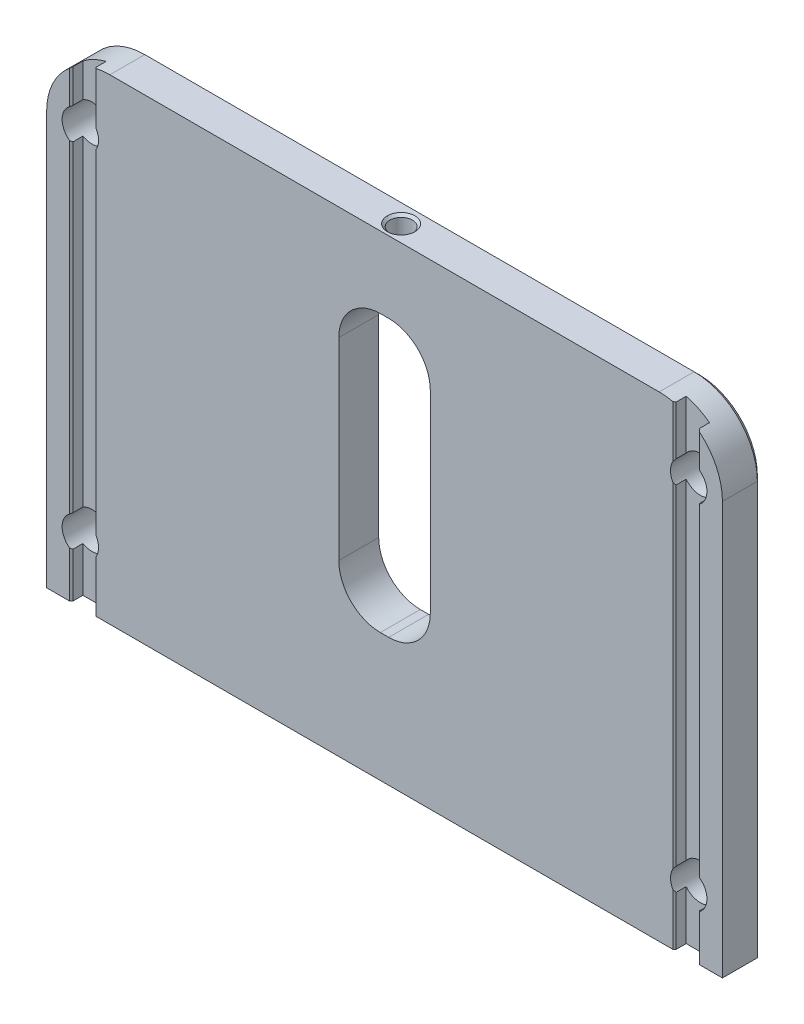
ISO-10303-21;
HEADER;
FILE_DESCRIPTION(('STEP AP214'),'2;1');
FILE_NAME('part.step','',(''),(''),'','','');
FILE_SCHEMA(('AUTOMOTIVE_DESIGN { 1 0 10303 214 1 1 1 1 }'));
ENDSEC;
DATA;
#1=APPLICATION_CONTEXT('core data for automotive mechanical design processes');
#2=APPLICATION_PROTOCOL_DEFINITION('international standard','automotive_design',2000,#1);
#3=PRODUCT_CONTEXT('',#1,'mechanical');
#4=PRODUCT('Part','Part','',(#3));
#5=PRODUCT_RELATED_PRODUCT_CATEGORY('part','',(#4));
#6=PRODUCT_DEFINITION_FORMATION('','',#4);
#7=PRODUCT_DEFINITION_CONTEXT('part definition',#1,'design');
#8=PRODUCT_DEFINITION('design','',#6,#7);
#9=PRODUCT_DEFINITION_SHAPE('','',#8);
#10=(LENGTH_UNIT() NAMED_UNIT(*) SI_UNIT(.MILLI.,.METRE.));
#11=(NAMED_UNIT(*) PLANE_ANGLE_UNIT() SI_UNIT($,.RADIAN.));
#12=(NAMED_UNIT(*) SI_UNIT($,.STERADIAN.) SOLID_ANGLE_UNIT());
#13=UNCERTAINTY_MEASURE_WITH_UNIT(LENGTH_MEASURE(1.E-05),#10,'distance_accuracy_value','');
#14=(GEOMETRIC_REPRESENTATION_CONTEXT(3) GLOBAL_UNCERTAINTY_ASSIGNED_CONTEXT((#13)) GLOBAL_UNIT_ASSIGNED_CONTEXT((#10,
#11,#12)) REPRESENTATION_CONTEXT('',''));
#15=CARTESIAN_POINT('',(0.,0.,0.));
#16=DIRECTION('',(0.,0.,1.));
#17=DIRECTION('',(1.,0.,0.));
#18=AXIS2_PLACEMENT_3D('',#15,#16,#17);
#19=CARTESIAN_POINT('',(-6.731,61.976,-205.600088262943));
#20=DIRECTION('',(0.,-1.,0.));
#21=DIRECTION('',(0.,0.,-1.));
#22=AXIS2_PLACEMENT_3D('',#19,#20,#21);
#23=PLANE('',#22);
#24=DIRECTION('',(0.,0.,1.));
#25=VECTOR('',#24,1.);
#26=CARTESIAN_POINT('',(0.635,61.976,-16.256));
#27=LINE('',#26,#25);
#28=CARTESIAN_POINT('',(0.635,61.976,-17.1897637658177));
#29=VERTEX_POINT('',#28);
#30=CARTESIAN_POINT('',(0.635,61.976,-16.812359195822));
#31=VERTEX_POINT('',#30);
#32=EDGE_CURVE('E764',#29,#31,#27,.T.);
#33=ORIENTED_EDGE('',*,*,#32,.T.);
#34=CARTESIAN_POINT('',(0.,61.976,-18.796));
#35=DIRECTION('',(0.,-1.,0.));
#36=DIRECTION('',(0.,0.,-1.));
#37=AXIS2_PLACEMENT_3D('',#34,#35,#36);
#38=CIRCLE('',#37,2.0828);
#39=CARTESIAN_POINT('',(-0.635,61.976,-16.812359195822));
#40=VERTEX_POINT('',#39);
#41=EDGE_CURVE('E806',#31,#40,#38,.T.);
#42=ORIENTED_EDGE('',*,*,#41,.T.);
#43=DIRECTION('',(0.,0.,1.));
#44=VECTOR('',#43,1.);
#45=CARTESIAN_POINT('',(-0.635,61.976,-22.352));
#46=LINE('',#45,#44);
#47=CARTESIAN_POINT('',(-0.635,61.976,-17.1897637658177));
#48=VERTEX_POINT('',#47);
#49=EDGE_CURVE('E727',#40,#48,#46,.F.);
#50=ORIENTED_EDGE('',*,*,#49,.T.);
#51=CARTESIAN_POINT('',(0.,61.976,-18.796));
#52=DIRECTION('',(0.,-1.,0.));
#53=DIRECTION('',(0.,0.,-1.));
#54=AXIS2_PLACEMENT_3D('',#51,#52,#53);
#55=CIRCLE('',#54,1.7272);
#56=EDGE_CURVE('E762',#48,#29,#55,.F.);
#57=ORIENTED_EDGE('',*,*,#56,.T.);
#58=EDGE_LOOP('',(#33,#42,#50,#57));
#59=FACE_BOUND('',#58,.T.);
#60=ADVANCED_FACE('F15',(#59),#23,.T.);
#61=DIRECTION('',(0.,0.,1.));
#62=VECTOR('',#61,1.);
#63=CARTESIAN_POINT('',(-0.635,61.976,-22.352));
#64=LINE('',#63,#62);
#65=CARTESIAN_POINT('',(-0.635,61.976,-20.4022362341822));
#66=VERTEX_POINT('',#65);
#67=CARTESIAN_POINT('',(-0.635,61.976,-20.779640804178));
#68=VERTEX_POINT('',#67);
#69=EDGE_CURVE('E724',#66,#68,#64,.F.);
#70=ORIENTED_EDGE('',*,*,#69,.T.);
#71=CARTESIAN_POINT('',(0.,61.976,-18.796));
#72=DIRECTION('',(0.,-1.,0.));
#73=DIRECTION('',(0.,0.,-1.));
#74=AXIS2_PLACEMENT_3D('',#71,#72,#73);
#75=CIRCLE('',#74,2.0828);
#76=CARTESIAN_POINT('',(0.635,61.976,-20.779640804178));
#77=VERTEX_POINT('',#76);
#78=EDGE_CURVE('E827',#68,#77,#75,.T.);
#79=ORIENTED_EDGE('',*,*,#78,.T.);
#80=DIRECTION('',(0.,0.,1.));
#81=VECTOR('',#80,1.);
#82=CARTESIAN_POINT('',(0.635,61.976,-16.256));
#83=LINE('',#82,#81);
#84=CARTESIAN_POINT('',(0.635,61.976,-20.4022362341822));
#85=VERTEX_POINT('',#84);
#86=EDGE_CURVE('E850',#77,#85,#83,.T.);
#87=ORIENTED_EDGE('',*,*,#86,.T.);
#88=EDGE_CURVE('E887',#85,#66,#55,.F.);
#89=ORIENTED_EDGE('',*,*,#88,.T.);
#90=EDGE_LOOP('',(#70,#79,#87,#89));
#91=FACE_BOUND('',#90,.T.);
#92=ADVANCED_FACE('F772',(#91),#23,.T.);
#93=CARTESIAN_POINT('',(0.635,55.626,-205.600088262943));
#94=DIRECTION('',(0.,0.,-1.));
#95=DIRECTION('',(-1.,0.,0.));
#96=AXIS2_PLACEMENT_3D('',#93,#94,#95);
#97=CYLINDRICAL_SURFACE('',#96,6.35);
#98=CARTESIAN_POINT('',(0.635,61.976,-16.812359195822));
#99=CARTESIAN_POINT('',(0.69008338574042,61.9760034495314,-16.8299914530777));
#100=CARTESIAN_POINT('',(0.744401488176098,61.9752826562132,-16.849911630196));
#101=CARTESIAN_POINT('',(0.851154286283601,61.9725439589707,-16.8941765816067));
#102=CARTESIAN_POINT('',(0.903589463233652,61.970526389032,-16.9185202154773));
#103=CARTESIAN_POINT('',(1.05730986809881,61.9627686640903,-16.9978337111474));
#104=CARTESIAN_POINT('',(1.15530731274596,61.95532188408,-17.0591818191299));
#105=CARTESIAN_POINT('',(1.33955738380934,61.9374734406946,-17.1969714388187));
#106=CARTESIAN_POINT('',(1.42581564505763,61.927073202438,-17.2734056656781));
#107=CARTESIAN_POINT('',(1.58454600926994,61.9051152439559,-17.439367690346));
#108=CARTESIAN_POINT('',(1.65701363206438,61.8935571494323,-17.5288997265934));
#109=CARTESIAN_POINT('',(1.78764917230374,61.8708704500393,-17.7207664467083));
#110=CARTESIAN_POINT('',(1.8454766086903,61.8597563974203,-17.8233347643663));
#111=CARTESIAN_POINT('',(1.94309819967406,61.8400056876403,-18.0369249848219));
#112=CARTESIAN_POINT('',(1.9829015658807,61.8313677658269,-18.1479425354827));
#113=CARTESIAN_POINT('',(2.03609087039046,61.8195467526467,-18.3482937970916));
#114=CARTESIAN_POINT('',(2.05350162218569,61.815556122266,-18.4365324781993));
#115=CARTESIAN_POINT('',(2.07682999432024,61.8101459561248,-18.6145571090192));
#116=CARTESIAN_POINT('',(2.08275191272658,61.80872545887,-18.7043424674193));
#117=CARTESIAN_POINT('',(2.0827992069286,61.8087483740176,-18.7941824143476));
#118=B_SPLINE_CURVE_WITH_KNOTS('',3,(#98,#99,#100,#101,#102,#103,#104,#105,#106,#107,#108,#109,
#110,#111,#112,#113,#114,#115,#116,#117),.UNSPECIFIED.,.F.,.F.,(4,2,2,2,2,2,2,2,2,4),(0.,
0.173395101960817,0.346745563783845,0.692521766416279,1.03813140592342,1.38385313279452,
1.73699872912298,2.08996363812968,2.35929463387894,2.62852485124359),.UNSPECIFIED.);
#119=CARTESIAN_POINT('',(2.0827992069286,61.8087483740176,-18.7941824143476));
#120=VERTEX_POINT('',#119);
#121=EDGE_CURVE('E805',#31,#120,#118,.T.);
#122=ORIENTED_EDGE('',*,*,#121,.F.);
#123=ORIENTED_EDGE('',*,*,#32,.F.);
#124=CARTESIAN_POINT('',(0.635,61.976,-20.4022362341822));
#125=CARTESIAN_POINT('',(0.67987144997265,61.9760021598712,-20.3844973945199));
#126=CARTESIAN_POINT('',(0.72397534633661,61.9755240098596,-20.3648858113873));
#127=CARTESIAN_POINT('',(0.810368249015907,61.9737246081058,-20.3220566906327));
#128=CARTESIAN_POINT('',(0.852657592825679,61.9724035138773,-20.2988398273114));
#129=CARTESIAN_POINT('',(0.976224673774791,61.967359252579,-20.2240910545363));
#130=CARTESIAN_POINT('',(1.05440440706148,61.9625540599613,-20.1673804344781));
#131=CARTESIAN_POINT('',(1.20012297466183,61.9512272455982,-20.0418672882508));
#132=CARTESIAN_POINT('',(1.26766290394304,61.9447058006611,-19.9730660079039));
#133=CARTESIAN_POINT('',(1.39037849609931,61.9312136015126,-19.8252193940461));
#134=CARTESIAN_POINT('',(1.44555311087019,61.9242428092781,-19.7461731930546));
#135=CARTESIAN_POINT('',(1.54261923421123,61.9109954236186,-19.5789473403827));
#136=CARTESIAN_POINT('',(1.58434050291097,61.904728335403,-19.4906680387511));
#137=CARTESIAN_POINT('',(1.65236334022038,61.8940671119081,-19.3082402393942));
#138=CARTESIAN_POINT('',(1.67866475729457,61.8896729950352,-19.2140916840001));
#139=CARTESIAN_POINT('',(1.71491969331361,61.8835245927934,-19.0232488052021));
#140=CARTESIAN_POINT('',(1.7249789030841,61.8817532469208,-18.9265751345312));
#141=CARTESIAN_POINT('',(1.72876192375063,61.8810930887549,-18.7329056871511));
#142=CARTESIAN_POINT('',(1.72248730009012,61.8822040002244,-18.6359099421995));
#143=CARTESIAN_POINT('',(1.69396871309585,61.8870931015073,-18.4454935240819));
#144=CARTESIAN_POINT('',(1.67190566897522,61.8908410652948,-18.3520448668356));
#145=CARTESIAN_POINT('',(1.61267400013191,61.9003562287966,-18.1701814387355));
#146=CARTESIAN_POINT('',(1.57550551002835,61.9061234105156,-18.0817666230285));
#147=CARTESIAN_POINT('',(1.48674868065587,61.9187770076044,-17.9116467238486));
#148=CARTESIAN_POINT('',(1.43504291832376,61.9256723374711,-17.830003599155));
#149=CARTESIAN_POINT('',(1.3187184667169,61.9393547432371,-17.6764083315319));
#150=CARTESIAN_POINT('',(1.25409184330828,61.946141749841,-17.6044621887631));
#151=CARTESIAN_POINT('',(1.11290571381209,61.9583914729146,-17.4715482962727));
#152=CARTESIAN_POINT('',(1.03622058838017,61.9638384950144,-17.4107126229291));
#153=CARTESIAN_POINT('',(0.873708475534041,61.9720288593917,-17.3029110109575));
#154=CARTESIAN_POINT('',(0.787905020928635,61.9747789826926,-17.255910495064));
#155=CARTESIAN_POINT('',(0.677753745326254,61.9758921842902,-17.2071608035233));
#156=CARTESIAN_POINT('',(0.656458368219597,61.9760015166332,-17.1982436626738));
#157=CARTESIAN_POINT('',(0.635,61.976,-17.1897637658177));
#158=B_SPLINE_CURVE_WITH_KNOTS('',3,(#124,#125,#126,#127,#128,#129,#130,#131,#132,#133,#134,
#135,#136,#137,#138,#139,#140,#141,#142,#143,#144,#145,#146,#147,#148,#149,#150,#151,#152,#153,
#154,#155,#156,#157),.UNSPECIFIED.,.F.,.F.,(4,2,2,2,2,2,2,2,2,2,2,2,2,2,2,2,4),(0.,
0.144657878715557,0.289288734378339,0.57790393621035,0.866489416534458,1.15509934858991,
1.44722980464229,1.73936313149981,2.02958772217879,2.31978449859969,2.60670809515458,
2.89362913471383,3.18293783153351,3.47242472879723,3.76515602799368,4.05714938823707,
4.12638972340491),.UNSPECIFIED.);
#159=EDGE_CURVE('E635',#85,#29,#158,.T.);
#160=ORIENTED_EDGE('',*,*,#159,.F.);
#161=ORIENTED_EDGE('',*,*,#86,.F.);
#162=CARTESIAN_POINT('',(2.0828,61.8087481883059,-18.796));
#163=CARTESIAN_POINT('',(2.08280054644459,61.8087432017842,-18.8538939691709));
#164=CARTESIAN_POINT('',(2.08038462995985,61.8093143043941,-18.9117592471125));
#165=CARTESIAN_POINT('',(2.07075271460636,61.8115598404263,-19.0270578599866));
#166=CARTESIAN_POINT('',(2.06353751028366,61.8132340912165,-19.0844912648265));
#167=CARTESIAN_POINT('',(2.03479195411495,61.8198269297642,-19.2553080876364));
#168=CARTESIAN_POINT('',(2.00616125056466,61.8263161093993,-19.3675192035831));
#169=CARTESIAN_POINT('',(1.93086713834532,61.8424853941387,-19.5853741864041));
#170=CARTESIAN_POINT('',(1.88420618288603,61.852165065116,-19.6910189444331));
#171=CARTESIAN_POINT('',(1.7741766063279,61.8732317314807,-19.8930801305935));
#172=CARTESIAN_POINT('',(1.71080251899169,61.8846192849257,-19.9894935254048));
#173=CARTESIAN_POINT('',(1.5678000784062,61.9075368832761,-20.1721353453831));
#174=CARTESIAN_POINT('',(1.4879083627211,61.9190659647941,-20.2581576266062));
#175=CARTESIAN_POINT('',(1.31469470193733,61.9401196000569,-20.415666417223));
#176=CARTESIAN_POINT('',(1.22138029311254,61.9496452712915,-20.487161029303));
#177=CARTESIAN_POINT('',(1.04686523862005,61.963083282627,-20.5988377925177));
#178=CARTESIAN_POINT('',(0.967890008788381,61.9677857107,-20.6424355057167));
#179=CARTESIAN_POINT('',(0.804897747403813,61.9742578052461,-20.7191064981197));
#180=CARTESIAN_POINT('',(0.720881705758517,61.9760280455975,-20.7521818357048));
#181=CARTESIAN_POINT('',(0.63499999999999,61.976,-20.779640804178));
#182=B_SPLINE_CURVE_WITH_KNOTS('',3,(#162,#163,#164,#165,#166,#167,#168,#169,#170,#171,#172,
#173,#174,#175,#176,#177,#178,#179,#180,#181),.UNSPECIFIED.,.F.,.F.,(4,2,2,2,2,2,2,2,2,4),(0.,
0.173572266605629,0.347115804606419,0.69328177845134,1.03940066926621,1.38563290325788,
1.73788280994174,2.08993570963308,2.36016289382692,2.63033718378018),.UNSPECIFIED.);
#183=CARTESIAN_POINT('',(2.0828,61.8087481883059,-18.796));
#184=VERTEX_POINT('',#183);
#185=EDGE_CURVE('E798',#184,#77,#182,.T.);
#186=ORIENTED_EDGE('',*,*,#185,.F.);
#187=CARTESIAN_POINT('',(0.635,55.626,-18.796));
#188=DIRECTION('',(0.,0.,1.));
#189=DIRECTION('',(1.,0.,0.));
#190=AXIS2_PLACEMENT_3D('',#187,#188,#189);
#191=CIRCLE('',#190,6.35);
#192=CARTESIAN_POINT('',(2.083054,61.8086887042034,-18.796));
#193=VERTEX_POINT('',#192);
#194=EDGE_CURVE('E868',#193,#184,#191,.T.);
#195=ORIENTED_EDGE('',*,*,#194,.F.);
#196=CARTESIAN_POINT('',(2.083054,61.8086887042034,-18.796));
#197=CARTESIAN_POINT('',(2.08305454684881,61.8086837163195,-18.8539007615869));
#198=CARTESIAN_POINT('',(2.08063835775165,61.80925498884,-18.9117728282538));
#199=CARTESIAN_POINT('',(2.07100535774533,61.8115011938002,-19.0270849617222));
#200=CARTESIAN_POINT('',(2.06378934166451,61.8131759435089,-19.0845250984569));
#201=CARTESIAN_POINT('',(2.03504056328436,61.8197707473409,-19.2553618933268));
#202=CARTESIAN_POINT('',(2.00640666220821,61.8262618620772,-19.3675861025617));
#203=CARTESIAN_POINT('',(1.93110419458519,61.8424360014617,-19.5854664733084));
#204=CARTESIAN_POINT('',(1.88443808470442,61.8521185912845,-19.691123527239));
#205=CARTESIAN_POINT('',(1.77439639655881,61.8731917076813,-19.893208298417));
#206=CARTESIAN_POINT('',(1.71101534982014,61.8845827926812,-19.9896329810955));
#207=CARTESIAN_POINT('',(1.5679967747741,61.9075077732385,-20.1722968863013));
#208=CARTESIAN_POINT('',(1.48809576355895,61.9190407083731,-20.2583298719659));
#209=CARTESIAN_POINT('',(1.31486181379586,61.9401017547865,-20.4158584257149));
#210=CARTESIAN_POINT('',(1.22153641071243,61.94963098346,-20.4873620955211));
#211=CARTESIAN_POINT('',(1.04698802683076,61.963075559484,-20.5990612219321));
#212=CARTESIAN_POINT('',(0.967989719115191,61.9677807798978,-20.6426710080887));
#213=CARTESIAN_POINT('',(0.804949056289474,61.974256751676,-20.7193613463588));
#214=CARTESIAN_POINT('',(0.720907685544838,61.9760280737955,-20.7524439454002));
#215=CARTESIAN_POINT('',(0.634999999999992,61.976,-20.7799074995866));
#216=B_SPLINE_CURVE_WITH_KNOTS('',3,(#196,#197,#198,#199,#200,#201,#202,#203,#204,#205,#206,
#207,#208,#209,#210,#211,#212,#213,#214,#215),.UNSPECIFIED.,.F.,.F.,(4,2,2,2,2,2,2,2,2,4),(0.,
0.173592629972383,0.347156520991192,0.693362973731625,1.03952227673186,1.38579497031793,
1.73808811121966,2.09018426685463,2.3604893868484,2.63074191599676),.UNSPECIFIED.);
#217=CARTESIAN_POINT('',(0.635,61.976,-20.7799074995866));
#218=VERTEX_POINT('',#217);
#219=EDGE_CURVE('E783',#193,#218,#216,.T.);
#220=ORIENTED_EDGE('',*,*,#219,.T.);
#221=CARTESIAN_POINT('',(0.635,61.976,-22.352));
#222=VERTEX_POINT('',#221);
#223=EDGE_CURVE('E708',#222,#218,#83,.T.);
#224=ORIENTED_EDGE('',*,*,#223,.F.);
#225=CARTESIAN_POINT('',(0.635,55.626,-22.352));
#226=DIRECTION('',(0.,0.,-1.));
#227=DIRECTION('',(-1.,0.,0.));
#228=AXIS2_PLACEMENT_3D('',#225,#226,#227);
#229=CIRCLE('',#228,6.35);
#230=CARTESIAN_POINT('',(6.985,55.626,-22.352));
#231=VERTEX_POINT('',#230);
#232=EDGE_CURVE('E865',#231,#222,#229,.F.);
#233=ORIENTED_EDGE('',*,*,#232,.F.);
#234=DIRECTION('',(0.,0.,1.));
#235=VECTOR('',#234,1.);
#236=CARTESIAN_POINT('',(6.985,55.626,-22.352));
#237=LINE('',#236,#235);
#238=CARTESIAN_POINT('',(6.985,55.626,-16.256));
#239=VERTEX_POINT('',#238);
#240=EDGE_CURVE('E950',#239,#231,#237,.F.);
#241=ORIENTED_EDGE('',*,*,#240,.F.);
#242=CARTESIAN_POINT('',(0.635,55.626,-16.256));
#243=DIRECTION('',(0.,0.,1.));
#244=DIRECTION('',(1.,0.,0.));
#245=AXIS2_PLACEMENT_3D('',#242,#243,#244);
#246=CIRCLE('',#245,6.35);
#247=CARTESIAN_POINT('',(0.635,61.976,-16.256));
#248=VERTEX_POINT('',#247);
#249=EDGE_CURVE('E955',#248,#239,#246,.F.);
#250=ORIENTED_EDGE('',*,*,#249,.F.);
#251=CARTESIAN_POINT('',(0.635,61.976,-16.8120925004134));
#252=VERTEX_POINT('',#251);
#253=EDGE_CURVE('E844',#252,#248,#27,.T.);
#254=ORIENTED_EDGE('',*,*,#253,.F.);
#255=CARTESIAN_POINT('',(0.635,61.976,-16.8120925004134));
#256=CARTESIAN_POINT('',(0.690090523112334,61.9760034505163,-16.8297246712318));
#257=CARTESIAN_POINT('',(0.744415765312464,61.9752824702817,-16.8496450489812));
#258=CARTESIAN_POINT('',(0.851182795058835,61.9725430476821,-16.8939109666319));
#259=CARTESIAN_POINT('',(0.903625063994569,61.970524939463,-16.9182553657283));
#260=CARTESIAN_POINT('',(1.05736653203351,61.9627651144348,-16.9975719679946));
#261=CARTESIAN_POINT('',(1.15537781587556,61.9553162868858,-17.0589232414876));
#262=CARTESIAN_POINT('',(1.33965479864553,61.937462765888,-17.1967212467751));
#263=CARTESIAN_POINT('',(1.42592613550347,61.9270594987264,-17.2731606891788));
#264=CARTESIAN_POINT('',(1.58468168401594,61.9050948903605,-17.4391350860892));
#265=CARTESIAN_POINT('',(1.65716141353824,61.8935331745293,-17.5286742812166));
#266=CARTESIAN_POINT('',(1.78782065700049,61.870838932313,-17.7205579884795));
#267=CARTESIAN_POINT('',(1.8456595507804,61.8597209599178,-17.823136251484));
#268=CARTESIAN_POINT('',(1.9433022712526,61.8399628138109,-18.0367482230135));
#269=CARTESIAN_POINT('',(1.98311530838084,61.8313213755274,-18.1477775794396));
#270=CARTESIAN_POINT('',(2.03632360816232,61.8194941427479,-18.3481654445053));
#271=CARTESIAN_POINT('',(2.0537422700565,61.8155009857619,-18.4364290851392));
#272=CARTESIAN_POINT('',(2.0770812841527,61.8100873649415,-18.6145047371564));
#273=CARTESIAN_POINT('',(2.0830059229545,61.8086659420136,-18.7043161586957));
#274=CARTESIAN_POINT('',(2.08305320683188,61.8086888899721,-18.7941821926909));
#275=B_SPLINE_CURVE_WITH_KNOTS('',3,(#255,#256,#257,#258,#259,#260,#261,#262,#263,#264,#265,
#266,#267,#268,#269,#270,#271,#272,#273,#274),.UNSPECIFIED.,.F.,.F.,(4,2,2,2,2,2,2,2,2,4),(0.,
0.173415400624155,0.346786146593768,0.692602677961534,1.03825254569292,1.38401455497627,
1.73720373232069,2.09021224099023,2.35962104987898,2.62892936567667),.UNSPECIFIED.);
#276=CARTESIAN_POINT('',(2.08305320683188,61.8086888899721,-18.7941821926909));
#277=VERTEX_POINT('',#276);
#278=EDGE_CURVE('E791',#252,#277,#275,.T.);
#279=ORIENTED_EDGE('',*,*,#278,.T.);
#280=CARTESIAN_POINT('',(0.635,55.626,-18.7954458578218));
#281=DIRECTION('',(-0.000872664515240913,0.,0.99999961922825));
#282=DIRECTION('',(-0.99999961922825,0.,-0.000872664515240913));
#283=AXIS2_PLACEMENT_3D('',#280,#281,#282);
#284=ELLIPSE('',#283,6.35000241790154,6.35);
#285=EDGE_CURVE('E424',#120,#277,#284,.F.);
#286=ORIENTED_EDGE('',*,*,#285,.F.);
#287=EDGE_LOOP('',(#122,#123,#160,#161,#186,#195,#220,#224,#233,#241,#250,#254,#279,#286));
#288=FACE_BOUND('',#287,.T.);
#289=ADVANCED_FACE('F766',(#288),#97,.F.);
#290=CARTESIAN_POINT('',(-0.635,55.626,-205.600088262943));
#291=DIRECTION('',(0.,0.,-1.));
#292=DIRECTION('',(-1.,0.,0.));
#293=AXIS2_PLACEMENT_3D('',#290,#291,#292);
#294=CYLINDRICAL_SURFACE('',#293,6.35);
#295=CARTESIAN_POINT('',(-0.635,61.976,-20.779640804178));
#296=CARTESIAN_POINT('',(-0.690086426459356,61.9760034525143,-20.7620075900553));
#297=CARTESIAN_POINT('',(-0.744407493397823,61.9752825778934,-20.7420861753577));
#298=CARTESIAN_POINT('',(-0.8511659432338,61.9725435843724,-20.6978182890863));
#299=CARTESIAN_POINT('',(-0.903603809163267,61.9705258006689,-20.6734729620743));
#300=CARTESIAN_POINT('',(-1.05732064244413,61.9627678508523,-20.5941595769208));
#301=CARTESIAN_POINT('',(-1.15531233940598,61.9553214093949,-20.5328145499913));
#302=CARTESIAN_POINT('',(-1.33955807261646,61.9374733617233,-20.3950279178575));
#303=CARTESIAN_POINT('',(-1.42581701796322,61.9270729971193,-20.3185926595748));
#304=CARTESIAN_POINT('',(-1.58454693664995,61.9051151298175,-20.1526315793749));
#305=CARTESIAN_POINT('',(-1.65701362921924,61.8935572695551,-20.0631017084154));
#306=CARTESIAN_POINT('',(-1.78763423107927,61.8708729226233,-19.8712540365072));
#307=CARTESIAN_POINT('',(-1.84545140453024,61.8597608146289,-19.7687049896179));
#308=CARTESIAN_POINT('',(-1.94307761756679,61.8400105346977,-19.5551354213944));
#309=CARTESIAN_POINT('',(-1.98288745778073,61.8313722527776,-19.4441152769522));
#310=CARTESIAN_POINT('',(-2.04307590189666,61.8179930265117,-19.2173906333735));
#311=CARTESIAN_POINT('',(-2.06356739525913,61.8132294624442,-19.101717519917));
#312=CARTESIAN_POINT('',(-2.08482790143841,61.8082830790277,-18.8684885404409));
#313=CARTESIAN_POINT('',(-2.08560078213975,61.8080993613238,-18.7509330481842));
#314=CARTESIAN_POINT('',(-2.06762142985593,61.8122889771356,-18.5201685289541));
#315=CARTESIAN_POINT('',(-2.04932160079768,61.8165567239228,-18.4069219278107));
#316=CARTESIAN_POINT('',(-1.99448396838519,61.8288287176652,-18.185148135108));
#317=CARTESIAN_POINT('',(-1.95794466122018,61.8368332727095,-18.0766213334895));
#318=CARTESIAN_POINT('',(-1.86739334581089,61.8554339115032,-17.8664356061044));
#319=CARTESIAN_POINT('',(-1.813257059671,61.866048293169,-17.7648319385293));
#320=CARTESIAN_POINT('',(-1.68905873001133,61.8882221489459,-17.5719502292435));
#321=CARTESIAN_POINT('',(-1.61899141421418,61.89978193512,-17.4806756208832));
#322=CARTESIAN_POINT('',(-1.46289672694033,61.9223041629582,-17.3087904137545));
#323=CARTESIAN_POINT('',(-1.37652722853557,61.9332456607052,-17.2284876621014));
#324=CARTESIAN_POINT('',(-1.19132791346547,61.9522642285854,-17.0835209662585));
#325=CARTESIAN_POINT('',(-1.09251247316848,61.9603445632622,-17.0188392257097));
#326=CARTESIAN_POINT('',(-0.932429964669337,61.9692839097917,-16.9324642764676));
#327=CARTESIAN_POINT('',(-0.874506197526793,61.9717558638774,-16.9045931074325));
#328=CARTESIAN_POINT('',(-0.756367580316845,61.9751159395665,-16.8543305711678));
#329=CARTESIAN_POINT('',(-0.696155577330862,61.9760059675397,-16.8319326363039));
#330=CARTESIAN_POINT('',(-0.635,61.976,-16.812359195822));
#331=B_SPLINE_CURVE_WITH_KNOTS('',3,(#295,#296,#297,#298,#299,#300,#301,#302,#303,#304,#305,
#306,#307,#308,#309,#310,#311,#312,#313,#314,#315,#316,#317,#318,#319,#320,#321,#322,#323,#324,
#325,#326,#327,#328,#329,#330),.UNSPECIFIED.,.F.,.F.,(4,2,2,2,2,2,2,2,2,2,2,2,2,2,2,2,2,4),(0.,
0.17340468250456,0.346764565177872,0.692521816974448,1.03813395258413,1.38385318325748,
1.73691628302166,2.08996368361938,2.44093497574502,2.79183742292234,3.1346018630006,
3.47739456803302,3.8226628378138,4.16804553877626,4.5217021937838,4.87495402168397,
5.06767515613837,5.26016388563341),.UNSPECIFIED.);
#332=EDGE_CURVE('E822',#68,#40,#331,.T.);
#333=ORIENTED_EDGE('',*,*,#332,.F.);
#334=ORIENTED_EDGE('',*,*,#69,.F.);
#335=CARTESIAN_POINT('',(-0.635,61.976,-17.1897637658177));
#336=CARTESIAN_POINT('',(-0.679871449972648,61.9760021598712,-17.2075026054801));
#337=CARTESIAN_POINT('',(-0.723975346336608,61.9755240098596,-17.2271141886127));
#338=CARTESIAN_POINT('',(-0.810368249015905,61.9737246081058,-17.2699433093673));
#339=CARTESIAN_POINT('',(-0.852657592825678,61.9724035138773,-17.2931601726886));
#340=CARTESIAN_POINT('',(-0.976224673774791,61.967359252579,-17.3679089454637));
#341=CARTESIAN_POINT('',(-1.05440440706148,61.9625540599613,-17.4246195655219));
#342=CARTESIAN_POINT('',(-1.20012297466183,61.9512272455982,-17.5501327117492));
#343=CARTESIAN_POINT('',(-1.26766290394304,61.9447058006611,-17.6189339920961));
#344=CARTESIAN_POINT('',(-1.39037849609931,61.9312136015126,-17.7667806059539));
#345=CARTESIAN_POINT('',(-1.44555311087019,61.9242428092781,-17.8458268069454));
#346=CARTESIAN_POINT('',(-1.54261923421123,61.9109954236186,-18.0130526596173));
#347=CARTESIAN_POINT('',(-1.58434050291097,61.904728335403,-18.1013319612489));
#348=CARTESIAN_POINT('',(-1.65236334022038,61.8940671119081,-18.2837597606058));
#349=CARTESIAN_POINT('',(-1.67866475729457,61.8896729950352,-18.3779083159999));
#350=CARTESIAN_POINT('',(-1.71491969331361,61.8835245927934,-18.5687511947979));
#351=CARTESIAN_POINT('',(-1.7249789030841,61.8817532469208,-18.6654248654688));
#352=CARTESIAN_POINT('',(-1.72876192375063,61.8810930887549,-18.8590943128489));
#353=CARTESIAN_POINT('',(-1.72248730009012,61.8822040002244,-18.9560900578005));
#354=CARTESIAN_POINT('',(-1.69396871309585,61.8870931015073,-19.1465064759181));
#355=CARTESIAN_POINT('',(-1.67190566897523,61.8908410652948,-19.2399551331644));
#356=CARTESIAN_POINT('',(-1.61267400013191,61.9003562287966,-19.4218185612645));
#357=CARTESIAN_POINT('',(-1.57550551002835,61.9061234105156,-19.5102333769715));
#358=CARTESIAN_POINT('',(-1.48674868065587,61.9187770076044,-19.6803532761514));
#359=CARTESIAN_POINT('',(-1.43504291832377,61.9256723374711,-19.761996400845));
#360=CARTESIAN_POINT('',(-1.31871846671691,61.9393547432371,-19.9155916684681));
#361=CARTESIAN_POINT('',(-1.25409184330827,61.946141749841,-19.9875378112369));
#362=CARTESIAN_POINT('',(-1.11290571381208,61.9583914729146,-20.1204517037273));
#363=CARTESIAN_POINT('',(-1.03622058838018,61.9638384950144,-20.1812873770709));
#364=CARTESIAN_POINT('',(-0.873708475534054,61.9720288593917,-20.2890889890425));
#365=CARTESIAN_POINT('',(-0.787905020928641,61.9747789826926,-20.336089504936));
#366=CARTESIAN_POINT('',(-0.677753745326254,61.9758921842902,-20.3848391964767));
#367=CARTESIAN_POINT('',(-0.656458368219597,61.9760015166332,-20.3937563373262));
#368=CARTESIAN_POINT('',(-0.635,61.976,-20.4022362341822));
#369=B_SPLINE_CURVE_WITH_KNOTS('',3,(#335,#336,#337,#338,#339,#340,#341,#342,#343,#344,#345,
#346,#347,#348,#349,#350,#351,#352,#353,#354,#355,#356,#357,#358,#359,#360,#361,#362,#363,#364,
#365,#366,#367,#368),.UNSPECIFIED.,.F.,.F.,(4,2,2,2,2,2,2,2,2,2,2,2,2,2,2,2,4),(0.,
0.144657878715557,0.289288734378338,0.577903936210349,0.86648941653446,1.15509934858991,
1.44722980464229,1.73936313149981,2.02958772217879,2.31978449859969,2.60670809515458,
2.89362913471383,3.1829378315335,3.4724247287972,3.76515602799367,4.05714938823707,
4.1263897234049),.UNSPECIFIED.);
#370=EDGE_CURVE('E602',#48,#66,#369,.T.);
#371=ORIENTED_EDGE('',*,*,#370,.F.);
#372=ORIENTED_EDGE('',*,*,#49,.F.);
#373=EDGE_LOOP('',(#333,#334,#371,#372));
#374=FACE_BOUND('',#373,.T.);
#375=ADVANCED_FACE('F771',(#374),#294,.F.);
#376=CARTESIAN_POINT('',(0.,72.898,-18.796));
#377=DIRECTION('',(0.,1.,0.));
#378=DIRECTION('',(0.,0.,1.));
#379=AXIS2_PLACEMENT_3D('',#376,#377,#378);
#380=CONICAL_SURFACE('',#379,2.1082,0.785398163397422);
#381=CARTESIAN_POINT('',(0.,72.898,-18.796));
#382=DIRECTION('',(0.,1.,0.));
#383=DIRECTION('',(-1.,0.,0.));
#384=AXIS2_PLACEMENT_3D('',#381,#382,#383);
#385=CIRCLE('',#384,2.1082);
#386=CARTESIAN_POINT('',(-2.1082,72.898,-18.796));
#387=VERTEX_POINT('',#386);
#388=EDGE_CURVE('E431',#387,#387,#385,.F.);
#389=ORIENTED_EDGE('',*,*,#388,.F.);
#390=EDGE_LOOP('',(#389));
#391=FACE_BOUND('',#390,.T.);
#392=CARTESIAN_POINT('',(0.,72.517,-18.796));
#393=DIRECTION('',(0.,1.,0.));
#394=DIRECTION('',(0.,0.,1.));
#395=AXIS2_PLACEMENT_3D('',#392,#393,#394);
#396=CIRCLE('',#395,1.7272);
#397=CARTESIAN_POINT('',(0.,72.517,-17.0688));
#398=VERTEX_POINT('',#397);
#399=EDGE_CURVE('E417',#398,#398,#396,.T.);
#400=ORIENTED_EDGE('',*,*,#399,.F.);
#401=EDGE_LOOP('',(#400));
#402=FACE_BOUND('',#401,.T.);
#403=DIRECTION('',(0.707106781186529,0.707106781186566,0.));
#404=VECTOR('',#403,1.);
#405=CARTESIAN_POINT('',(0.,70.7898,-18.796));
#406=LINE('',#405,#404);
#407=CARTESIAN_POINT('',(2.083054,72.872854,-18.796));
#408=VERTEX_POINT('',#407);
#409=CARTESIAN_POINT('',(2.0828,72.8726,-18.796));
#410=VERTEX_POINT('',#409);
#411=EDGE_CURVE('E23',#408,#410,#406,.F.);
#412=ORIENTED_EDGE('',*,*,#411,.T.);
#413=CARTESIAN_POINT('',(0.,72.8726,-18.796));
#414=DIRECTION('',(0.,1.,0.));
#415=DIRECTION('',(0.,0.,1.));
#416=AXIS2_PLACEMENT_3D('',#413,#414,#415);
#417=CIRCLE('',#416,2.0828);
#418=CARTESIAN_POINT('',(2.0827992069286,72.8726,-18.7941824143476));
#419=VERTEX_POINT('',#418);
#420=EDGE_CURVE('E9',#410,#419,#417,.T.);
#421=ORIENTED_EDGE('',*,*,#420,.T.);
#422=DIRECTION('',(0.707106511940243,0.707106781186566,0.000617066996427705));
#423=VECTOR('',#422,1.);
#424=CARTESIAN_POINT('',(0.,70.7898,-18.796));
#425=LINE('',#424,#423);
#426=CARTESIAN_POINT('',(2.08305320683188,72.872854,-18.7941821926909));
#427=VERTEX_POINT('',#426);
#428=EDGE_CURVE('E416',#419,#427,#425,.T.);
#429=ORIENTED_EDGE('',*,*,#428,.T.);
#430=CARTESIAN_POINT('',(0.,72.872854,-18.796));
#431=DIRECTION('',(0.,1.,0.));
#432=DIRECTION('',(0.,0.,1.));
#433=AXIS2_PLACEMENT_3D('',#430,#431,#432);
#434=CIRCLE('',#433,2.083054);
#435=EDGE_CURVE('E408',#408,#427,#434,.T.);
#436=ORIENTED_EDGE('',*,*,#435,.F.);
#437=EDGE_LOOP('',(#412,#421,#429,#436));
#438=FACE_BOUND('',#437,.T.);
#439=ADVANCED_FACE('F426',(#391,#402,#438),#380,.F.);
#440=CARTESIAN_POINT('',(44.2595,72.898,-16.256));
#441=DIRECTION('',(0.,1.,0.));
#442=DIRECTION('',(-1.,0.,0.));
#443=AXIS2_PLACEMENT_3D('',#440,#441,#442);
#444=PLANE('',#443);
#445=ORIENTED_EDGE('',*,*,#388,.T.);
#446=EDGE_LOOP('',(#445));
#447=FACE_BOUND('',#446,.T.);
#448=DIRECTION('',(0.,0.,1.));
#449=VECTOR('',#448,1.);
#450=CARTESIAN_POINT('',(41.9227,72.898,-16.256));
#451=LINE('',#450,#449);
#452=CARTESIAN_POINT('',(41.9227,72.898,-16.256));
#453=VERTEX_POINT('',#452);
#454=CARTESIAN_POINT('',(41.9227,72.898,-21.59));
#455=VERTEX_POINT('',#454);
#456=EDGE_CURVE('E599',#453,#455,#451,.F.);
#457=ORIENTED_EDGE('',*,*,#456,.T.);
#458=DIRECTION('',(-1.,0.,0.));
#459=VECTOR('',#458,1.);
#460=CARTESIAN_POINT('',(44.2595,72.898,-21.59));
#461=LINE('',#460,#459);
#462=CARTESIAN_POINT('',(-41.9227,72.898,-21.59));
#463=VERTEX_POINT('',#462);
#464=EDGE_CURVE('E542',#455,#463,#461,.T.);
#465=ORIENTED_EDGE('',*,*,#464,.T.);
#466=DIRECTION('',(0.,0.,1.));
#467=VECTOR('',#466,1.);
#468=CARTESIAN_POINT('',(-41.9227,72.898,-16.256));
#469=LINE('',#468,#467);
#470=CARTESIAN_POINT('',(-41.9227,72.898,-16.256));
#471=VERTEX_POINT('',#470);
#472=EDGE_CURVE('E597',#463,#471,#469,.T.);
#473=ORIENTED_EDGE('',*,*,#472,.T.);
#474=DIRECTION('',(-1.,0.,0.));
#475=VECTOR('',#474,1.);
#476=CARTESIAN_POINT('',(42.8371,72.898,-16.256));
#477=LINE('',#476,#475);
#478=EDGE_CURVE('E896',#453,#471,#477,.T.);
#479=ORIENTED_EDGE('',*,*,#478,.F.);
#480=EDGE_LOOP('',(#457,#465,#473,#479));
#481=FACE_BOUND('',#480,.T.);
#482=ADVANCED_FACE('F1024',(#447,#481),#444,.T.);
#483=CARTESIAN_POINT('',(-51.5747,72.898,-22.352));
#484=DIRECTION('',(0.,0.,-1.));
#485=DIRECTION('',(-1.,0.,0.));
#486=AXIS2_PLACEMENT_3D('',#483,#484,#485);
#487=PLANE('',#486);
#488=CARTESIAN_POINT('',(41.9227,63.246,-22.352));
#489=DIRECTION('',(0.,0.,-1.));
#490=DIRECTION('',(-1.,0.,0.));
#491=AXIS2_PLACEMENT_3D('',#488,#489,#490);
#492=CIRCLE('',#491,8.89);
#493=CARTESIAN_POINT('',(41.9227,72.136,-22.352));
#494=VERTEX_POINT('',#493);
#495=CARTESIAN_POINT('',(50.8127,63.246,-22.352));
#496=VERTEX_POINT('',#495);
#497=EDGE_CURVE('E559',#494,#496,#492,.T.);
#498=ORIENTED_EDGE('',*,*,#497,.T.);
#499=DIRECTION('',(0.,-1.,0.));
#500=VECTOR('',#499,1.);
#501=CARTESIAN_POINT('',(50.8127,72.898,-22.352));
#502=LINE('',#501,#500);
#503=CARTESIAN_POINT('',(50.8127,1.016,-22.352));
#504=VERTEX_POINT('',#503);
#505=EDGE_CURVE('E555',#496,#504,#502,.T.);
#506=ORIENTED_EDGE('',*,*,#505,.T.);
#507=DIRECTION('',(-1.,0.,0.));
#508=VECTOR('',#507,1.);
#509=CARTESIAN_POINT('',(-51.5747,1.01599999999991,-22.352));
#510=LINE('',#509,#508);
#511=CARTESIAN_POINT('',(-50.8127,1.01599999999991,-22.352));
#512=VERTEX_POINT('',#511);
#513=EDGE_CURVE('E557',#504,#512,#510,.T.);
#514=ORIENTED_EDGE('',*,*,#513,.T.);
#515=DIRECTION('',(0.,1.,0.));
#516=VECTOR('',#515,1.);
#517=CARTESIAN_POINT('',(-50.8127,72.898,-22.352));
#518=LINE('',#517,#516);
#519=CARTESIAN_POINT('',(-50.8127,63.246,-22.352));
#520=VERTEX_POINT('',#519);
#521=EDGE_CURVE('E562',#512,#520,#518,.T.);
#522=ORIENTED_EDGE('',*,*,#521,.T.);
#523=CARTESIAN_POINT('',(-41.9227,63.246,-22.352));
#524=DIRECTION('',(0.,0.,-1.));
#525=DIRECTION('',(-1.,0.,0.));
#526=AXIS2_PLACEMENT_3D('',#523,#524,#525);
#527=CIRCLE('',#526,8.89);
#528=CARTESIAN_POINT('',(-41.9227,72.136,-22.352));
#529=VERTEX_POINT('',#528);
#530=EDGE_CURVE('E564',#520,#529,#527,.T.);
#531=ORIENTED_EDGE('',*,*,#530,.T.);
#532=DIRECTION('',(1.,0.,0.));
#533=VECTOR('',#532,1.);
#534=CARTESIAN_POINT('',(-51.5747,72.136,-22.352));
#535=LINE('',#534,#533);
#536=EDGE_CURVE('E566',#529,#494,#535,.T.);
#537=ORIENTED_EDGE('',*,*,#536,.T.);
#538=EDGE_LOOP('',(#498,#506,#514,#522,#531,#537));
#539=FACE_BOUND('',#538,.T.);
#540=DIRECTION('',(0.,1.,0.));
#541=VECTOR('',#540,1.);
#542=CARTESIAN_POINT('',(6.985,72.898,-22.352));
#543=LINE('',#542,#541);
#544=CARTESIAN_POINT('',(6.985,26.162,-22.352));
#545=VERTEX_POINT('',#544);
#546=EDGE_CURVE('E953',#545,#231,#543,.T.);
#547=ORIENTED_EDGE('',*,*,#546,.T.);
#548=ORIENTED_EDGE('',*,*,#232,.T.);
#549=DIRECTION('',(-1.,0.,0.));
#550=VECTOR('',#549,1.);
#551=CARTESIAN_POINT('',(-51.5747,61.976,-22.352));
#552=LINE('',#551,#550);
#553=CARTESIAN_POINT('',(-0.635,61.976,-22.352));
#554=VERTEX_POINT('',#553);
#555=EDGE_CURVE('E720',#222,#554,#552,.T.);
#556=ORIENTED_EDGE('',*,*,#555,.T.);
#557=CARTESIAN_POINT('',(-0.635,55.626,-22.352));
#558=DIRECTION('',(0.,0.,-1.));
#559=DIRECTION('',(-1.,0.,0.));
#560=AXIS2_PLACEMENT_3D('',#557,#558,#559);
#561=CIRCLE('',#560,6.35);
#562=CARTESIAN_POINT('',(-6.985,55.626,-22.352));
#563=VERTEX_POINT('',#562);
#564=EDGE_CURVE('E721',#554,#563,#561,.F.);
#565=ORIENTED_EDGE('',*,*,#564,.T.);
#566=DIRECTION('',(0.,-1.,0.));
#567=VECTOR('',#566,1.);
#568=CARTESIAN_POINT('',(-6.985,72.898,-22.352));
#569=LINE('',#568,#567);
#570=CARTESIAN_POINT('',(-6.985,26.162,-22.352));
#571=VERTEX_POINT('',#570);
#572=EDGE_CURVE('E716',#563,#571,#569,.T.);
#573=ORIENTED_EDGE('',*,*,#572,.T.);
#574=CARTESIAN_POINT('',(-0.635,26.162,-22.352));
#575=DIRECTION('',(0.,0.,-1.));
#576=DIRECTION('',(-1.,0.,0.));
#577=AXIS2_PLACEMENT_3D('',#574,#575,#576);
#578=CIRCLE('',#577,6.35);
#579=CARTESIAN_POINT('',(-0.635,19.812,-22.352));
#580=VERTEX_POINT('',#579);
#581=EDGE_CURVE('E707',#571,#580,#578,.F.);
#582=ORIENTED_EDGE('',*,*,#581,.T.);
#583=DIRECTION('',(1.,0.,0.));
#584=VECTOR('',#583,1.);
#585=CARTESIAN_POINT('',(-51.5747,19.812,-22.352));
#586=LINE('',#585,#584);
#587=CARTESIAN_POINT('',(0.635,19.812,-22.352));
#588=VERTEX_POINT('',#587);
#589=EDGE_CURVE('E648',#580,#588,#586,.T.);
#590=ORIENTED_EDGE('',*,*,#589,.T.);
#591=CARTESIAN_POINT('',(0.635,26.162,-22.352));
#592=DIRECTION('',(0.,0.,-1.));
#593=DIRECTION('',(-1.,0.,0.));
#594=AXIS2_PLACEMENT_3D('',#591,#592,#593);
#595=CIRCLE('',#594,6.35);
#596=EDGE_CURVE('E957',#588,#545,#595,.F.);
#597=ORIENTED_EDGE('',*,*,#596,.T.);
#598=EDGE_LOOP('',(#547,#548,#556,#565,#573,#582,#590,#597));
#599=FACE_BOUND('',#598,.T.);
#600=CARTESIAN_POINT('',(-46.4312,63.373,-22.352));
#601=DIRECTION('',(0.,0.,-1.));
#602=DIRECTION('',(-1.,0.,0.));
#603=AXIS2_PLACEMENT_3D('',#600,#601,#602);
#604=CIRCLE('',#603,2.778125);
#605=CARTESIAN_POINT('',(-49.209325,63.373,-22.352));
#606=VERTEX_POINT('',#605);
#607=EDGE_CURVE('E631',#606,#606,#604,.T.);
#608=ORIENTED_EDGE('',*,*,#607,.F.);
#609=EDGE_LOOP('',(#608));
#610=FACE_BOUND('',#609,.T.);
#611=CARTESIAN_POINT('',(46.4312,63.373,-22.352));
#612=DIRECTION('',(0.,0.,-1.));
#613=DIRECTION('',(-1.,0.,0.));
#614=AXIS2_PLACEMENT_3D('',#611,#612,#613);
#615=CIRCLE('',#614,2.778125);
#616=CARTESIAN_POINT('',(43.653075,63.373,-22.352));
#617=VERTEX_POINT('',#616);
#618=EDGE_CURVE('E658',#617,#617,#615,.T.);
#619=ORIENTED_EDGE('',*,*,#618,.F.);
#620=EDGE_LOOP('',(#619));
#621=FACE_BOUND('',#620,.T.);
#622=CARTESIAN_POINT('',(46.4312,9.525,-22.352));
#623=DIRECTION('',(0.,0.,-1.));
#624=DIRECTION('',(-1.,0.,0.));
#625=AXIS2_PLACEMENT_3D('',#622,#623,#624);
#626=CIRCLE('',#625,2.778125);
#627=CARTESIAN_POINT('',(43.653075,9.525,-22.352));
#628=VERTEX_POINT('',#627);
#629=EDGE_CURVE('E667',#628,#628,#626,.T.);
#630=ORIENTED_EDGE('',*,*,#629,.F.);
#631=EDGE_LOOP('',(#630));
#632=FACE_BOUND('',#631,.T.);
#633=CARTESIAN_POINT('',(-46.4312,9.525,-22.352));
#634=DIRECTION('',(0.,0.,-1.));
#635=DIRECTION('',(-1.,0.,0.));
#636=AXIS2_PLACEMENT_3D('',#633,#634,#635);
#637=CIRCLE('',#636,2.778125);
#638=CARTESIAN_POINT('',(-49.209325,9.525,-22.352));
#639=VERTEX_POINT('',#638);
#640=EDGE_CURVE('E603',#639,#639,#637,.T.);
#641=ORIENTED_EDGE('',*,*,#640,.F.);
#642=EDGE_LOOP('',(#641));
#643=FACE_BOUND('',#642,.T.);
#644=ADVANCED_FACE('F992',(#539,#599,#610,#621,#632,#643),#487,.T.);
#645=CARTESIAN_POINT('',(0.,61.976,-18.796));
#646=DIRECTION('',(0.,-1.,0.));
#647=DIRECTION('',(0.,0.,-1.));
#648=AXIS2_PLACEMENT_3D('',#645,#646,#647);
#649=CIRCLE('',#648,2.083054);
#650=CARTESIAN_POINT('',(-0.635,61.976,-16.8120925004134));
#651=VERTEX_POINT('',#650);
#652=EDGE_CURVE('E30',#252,#651,#649,.T.);
#653=ORIENTED_EDGE('',*,*,#652,.F.);
#654=ORIENTED_EDGE('',*,*,#253,.T.);
#655=DIRECTION('',(1.,0.,0.));
#656=VECTOR('',#655,1.);
#657=CARTESIAN_POINT('',(42.8371,61.976,-16.256));
#658=LINE('',#657,#656);
#659=CARTESIAN_POINT('',(-0.635,61.976,-16.256));
#660=VERTEX_POINT('',#659);
#661=EDGE_CURVE('E966',#660,#248,#658,.T.);
#662=ORIENTED_EDGE('',*,*,#661,.F.);
#663=EDGE_CURVE('E736',#660,#651,#46,.F.);
#664=ORIENTED_EDGE('',*,*,#663,.T.);
#665=EDGE_LOOP('',(#653,#654,#662,#664));
#666=FACE_BOUND('',#665,.T.);
#667=ADVANCED_FACE('F1002',(#666),#23,.T.);
#668=CARTESIAN_POINT('',(0.,61.976,-18.796));
#669=DIRECTION('',(0.,-1.,0.));
#670=DIRECTION('',(0.,0.,-1.));
#671=AXIS2_PLACEMENT_3D('',#668,#669,#670);
#672=CIRCLE('',#671,2.083054);
#673=CARTESIAN_POINT('',(-0.635,61.976,-20.7799074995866));
#674=VERTEX_POINT('',#673);
#675=EDGE_CURVE('E859',#674,#218,#672,.T.);
#676=ORIENTED_EDGE('',*,*,#675,.F.);
#677=EDGE_CURVE('E728',#674,#554,#64,.F.);
#678=ORIENTED_EDGE('',*,*,#677,.T.);
#679=ORIENTED_EDGE('',*,*,#555,.F.);
#680=ORIENTED_EDGE('',*,*,#223,.T.);
#681=EDGE_LOOP('',(#676,#678,#679,#680));
#682=FACE_BOUND('',#681,.T.);
#683=ADVANCED_FACE('F858',(#682),#23,.T.);
#684=ORIENTED_EDGE('',*,*,#677,.F.);
#685=CARTESIAN_POINT('',(-0.635,61.976,-20.7799074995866));
#686=CARTESIAN_POINT('',(-0.690093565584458,61.9760034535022,-20.7622743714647));
#687=CARTESIAN_POINT('',(-0.744421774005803,61.975282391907,-20.7423527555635));
#688=CARTESIAN_POINT('',(-0.851194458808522,61.9725426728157,-20.698083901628));
#689=CARTESIAN_POINT('',(-0.903639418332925,61.9705243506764,-20.6737378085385));
#690=CARTESIAN_POINT('',(-1.05737731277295,61.9627643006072,-20.5944213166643));
#691=CARTESIAN_POINT('',(-1.15538284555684,61.955315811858,-20.5330731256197));
#692=CARTESIAN_POINT('',(-1.33965548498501,61.937462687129,-20.3952781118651));
#693=CARTESIAN_POINT('',(-1.4259275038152,61.9270592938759,-20.3188376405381));
#694=CARTESIAN_POINT('',(-1.58468260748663,61.9050947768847,-20.1528641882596));
#695=CARTESIAN_POINT('',(-1.65716140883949,61.8935332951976,-20.0633271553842));
#696=CARTESIAN_POINT('',(-1.78780571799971,61.8708414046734,-19.8714624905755));
#697=CARTESIAN_POINT('',(-1.84563435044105,61.8597253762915,-19.7689034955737));
#698=CARTESIAN_POINT('',(-1.94328169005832,61.8399676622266,-19.5553121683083));
#699=CARTESIAN_POINT('',(-1.98310119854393,61.8313258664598,-19.4442802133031));
#700=CARTESIAN_POINT('',(-2.04330686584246,61.8179405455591,-19.2175302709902));
#701=CARTESIAN_POINT('',(-2.06380589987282,61.8131744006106,-19.1018436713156));
#702=CARTESIAN_POINT('',(-2.08507906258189,61.8082241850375,-18.8685865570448));
#703=CARTESIAN_POINT('',(-2.0858570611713,61.8080392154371,-18.7510164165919));
#704=CARTESIAN_POINT('',(-2.06788534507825,61.812227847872,-18.5202234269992));
#705=CARTESIAN_POINT('',(-2.04958827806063,61.8164957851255,-18.4069630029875));
#706=CARTESIAN_POINT('',(-1.99475400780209,61.8287695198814,-18.1851613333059));
#707=CARTESIAN_POINT('',(-1.95821529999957,61.8367756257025,-18.0766204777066));
#708=CARTESIAN_POINT('',(-1.86766315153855,61.8553805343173,-17.8664069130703));
#709=CARTESIAN_POINT('',(-1.81352545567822,61.8659976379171,-17.7647894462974));
#710=CARTESIAN_POINT('',(-1.68932229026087,61.8881778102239,-17.5718805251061));
#711=CARTESIAN_POINT('',(-1.6192515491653,61.8997411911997,-17.4805925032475));
#712=CARTESIAN_POINT('',(-1.46314714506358,61.9222713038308,-17.3086799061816));
#713=CARTESIAN_POINT('',(-1.37677116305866,61.9332170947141,-17.2283633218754));
#714=CARTESIAN_POINT('',(-1.19155658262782,61.9522442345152,-17.0833701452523));
#715=CARTESIAN_POINT('',(-1.09273235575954,61.9603288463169,-17.0186757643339));
#716=CARTESIAN_POINT('',(-0.932607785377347,61.9692758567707,-16.9322680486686));
#717=CARTESIAN_POINT('',(-0.874650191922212,61.9717507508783,-16.904378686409));
#718=CARTESIAN_POINT('',(-0.756441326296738,61.9751148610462,-16.8540855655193));
#719=CARTESIAN_POINT('',(-0.696192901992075,61.9760059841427,-16.8316752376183));
#720=CARTESIAN_POINT('',(-0.635,61.976,-16.8120925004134));
#721=B_SPLINE_CURVE_WITH_KNOTS('',3,(#685,#686,#687,#688,#689,#690,#691,#692,#693,#694,#695,
#696,#697,#698,#699,#700,#701,#702,#703,#704,#705,#706,#707,#708,#709,#710,#711,#712,#713,#714,
#715,#716,#717,#718,#719,#720),.UNSPECIFIED.,.F.,.F.,(4,2,2,2,2,2,2,2,2,2,2,2,2,2,2,2,2,4),(0.,
0.173424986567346,0.34680515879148,0.692602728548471,1.03825508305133,1.38401460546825,
1.73712130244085,2.09021228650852,2.44122739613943,2.79217362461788,3.1349774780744,
3.47780961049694,3.82311683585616,4.16853847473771,4.52223843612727,4.87553372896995,
5.06836978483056,5.26097348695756),.UNSPECIFIED.);
#722=EDGE_CURVE('E869',#674,#651,#721,.T.);
#723=ORIENTED_EDGE('',*,*,#722,.T.);
#724=ORIENTED_EDGE('',*,*,#663,.F.);
#725=CARTESIAN_POINT('',(-0.635,55.626,-16.256));
#726=DIRECTION('',(0.,0.,1.));
#727=DIRECTION('',(1.,0.,0.));
#728=AXIS2_PLACEMENT_3D('',#725,#726,#727);
#729=CIRCLE('',#728,6.35);
#730=CARTESIAN_POINT('',(-6.985,55.626,-16.256));
#731=VERTEX_POINT('',#730);
#732=EDGE_CURVE('E723',#731,#660,#729,.F.);
#733=ORIENTED_EDGE('',*,*,#732,.F.);
#734=DIRECTION('',(0.,0.,1.));
#735=VECTOR('',#734,1.);
#736=CARTESIAN_POINT('',(-6.985,55.626,-16.256));
#737=LINE('',#736,#735);
#738=EDGE_CURVE('E712',#563,#731,#737,.T.);
#739=ORIENTED_EDGE('',*,*,#738,.F.);
#740=ORIENTED_EDGE('',*,*,#564,.F.);
#741=EDGE_LOOP('',(#684,#723,#724,#733,#739,#740));
#742=FACE_BOUND('',#741,.T.);
#743=ADVANCED_FACE('F738',(#742),#294,.F.);
#744=CARTESIAN_POINT('',(42.8371,72.898,-16.256));
#745=DIRECTION('',(0.,0.,1.));
#746=DIRECTION('',(1.,0.,0.));
#747=AXIS2_PLACEMENT_3D('',#744,#745,#746);
#748=PLANE('',#747);
#749=CARTESIAN_POINT('',(-41.9227,63.246,-16.256));
#750=DIRECTION('',(0.,0.,1.));
#751=DIRECTION('',(1.,0.,0.));
#752=AXIS2_PLACEMENT_3D('',#749,#750,#751);
#753=CIRCLE('',#752,9.652);
#754=CARTESIAN_POINT('',(-44.0055,72.6705980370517,-16.256));
#755=VERTEX_POINT('',#754);
#756=EDGE_CURVE('E592',#471,#755,#753,.T.);
#757=ORIENTED_EDGE('',*,*,#756,.T.);
#758=DIRECTION('',(0.,-1.,0.));
#759=VECTOR('',#758,1.);
#760=CARTESIAN_POINT('',(-44.0055,72.898,-16.256));
#761=LINE('',#760,#759);
#762=CARTESIAN_POINT('',(-44.0055,64.727237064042,-16.256));
#763=VERTEX_POINT('',#762);
#764=EDGE_CURVE('E527',#755,#763,#761,.T.);
#765=ORIENTED_EDGE('',*,*,#764,.T.);
#766=CARTESIAN_POINT('',(-46.4312,63.373,-16.256));
#767=DIRECTION('',(0.,0.,1.));
#768=DIRECTION('',(1.,0.,0.));
#769=AXIS2_PLACEMENT_3D('',#766,#767,#768);
#770=CIRCLE('',#769,2.778125);
#771=CARTESIAN_POINT('',(-44.0055,62.018762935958,-16.256));
#772=VERTEX_POINT('',#771);
#773=EDGE_CURVE('E645',#772,#763,#770,.T.);
#774=ORIENTED_EDGE('',*,*,#773,.F.);
#775=DIRECTION('',(0.,-1.,0.));
#776=VECTOR('',#775,1.);
#777=CARTESIAN_POINT('',(-44.0055,72.898,-16.256));
#778=LINE('',#777,#776);
#779=CARTESIAN_POINT('',(-44.0055,10.879237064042,-16.256));
#780=VERTEX_POINT('',#779);
#781=EDGE_CURVE('E530',#772,#780,#778,.T.);
#782=ORIENTED_EDGE('',*,*,#781,.T.);
#783=CARTESIAN_POINT('',(-46.4312,9.525,-16.256));
#784=DIRECTION('',(0.,0.,1.));
#785=DIRECTION('',(1.,0.,0.));
#786=AXIS2_PLACEMENT_3D('',#783,#784,#785);
#787=CIRCLE('',#786,2.778125);
#788=CARTESIAN_POINT('',(-44.0055,8.17076293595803,-16.256));
#789=VERTEX_POINT('',#788);
#790=EDGE_CURVE('E617',#789,#780,#787,.T.);
#791=ORIENTED_EDGE('',*,*,#790,.F.);
#792=DIRECTION('',(0.,-1.,0.));
#793=VECTOR('',#792,1.);
#794=CARTESIAN_POINT('',(-44.0055,72.898,-16.256));
#795=LINE('',#794,#793);
#796=CARTESIAN_POINT('',(-44.0055,0.25399999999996,-16.256));
#797=VERTEX_POINT('',#796);
#798=EDGE_CURVE('E533',#789,#797,#795,.T.);
#799=ORIENTED_EDGE('',*,*,#798,.T.);
#800=DIRECTION('',(-1.,0.,0.));
#801=VECTOR('',#800,1.);
#802=CARTESIAN_POINT('',(42.8371,0.254,-16.256));
#803=LINE('',#802,#801);
#804=CARTESIAN_POINT('',(44.0055,0.254,-16.256));
#805=VERTEX_POINT('',#804);
#806=EDGE_CURVE('E893',#805,#797,#803,.T.);
#807=ORIENTED_EDGE('',*,*,#806,.F.);
#808=DIRECTION('',(0.,1.,0.));
#809=VECTOR('',#808,1.);
#810=CARTESIAN_POINT('',(44.0055,7.79245919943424,-16.256));
#811=LINE('',#810,#809);
#812=CARTESIAN_POINT('',(44.0055,8.17076293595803,-16.256));
#813=VERTEX_POINT('',#812);
#814=EDGE_CURVE('E536',#805,#813,#811,.T.);
#815=ORIENTED_EDGE('',*,*,#814,.T.);
#816=CARTESIAN_POINT('',(46.4312,9.525,-16.256));
#817=DIRECTION('',(0.,0.,1.));
#818=DIRECTION('',(1.,0.,0.));
#819=AXIS2_PLACEMENT_3D('',#816,#817,#818);
#820=CIRCLE('',#819,2.778125);
#821=CARTESIAN_POINT('',(44.0055,10.879237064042,-16.256));
#822=VERTEX_POINT('',#821);
#823=EDGE_CURVE('E620',#822,#813,#820,.T.);
#824=ORIENTED_EDGE('',*,*,#823,.F.);
#825=DIRECTION('',(0.,1.,0.));
#826=VECTOR('',#825,1.);
#827=CARTESIAN_POINT('',(44.0055,61.6404591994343,-16.256));
#828=LINE('',#827,#826);
#829=CARTESIAN_POINT('',(44.0055,62.018762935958,-16.256));
#830=VERTEX_POINT('',#829);
#831=EDGE_CURVE('E538',#822,#830,#828,.T.);
#832=ORIENTED_EDGE('',*,*,#831,.T.);
#833=CARTESIAN_POINT('',(46.4312,63.373,-16.256));
#834=DIRECTION('',(0.,0.,1.));
#835=DIRECTION('',(1.,0.,0.));
#836=AXIS2_PLACEMENT_3D('',#833,#834,#835);
#837=CIRCLE('',#836,2.778125);
#838=CARTESIAN_POINT('',(44.0055,64.727237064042,-16.256));
#839=VERTEX_POINT('',#838);
#840=EDGE_CURVE('E649',#839,#830,#837,.T.);
#841=ORIENTED_EDGE('',*,*,#840,.F.);
#842=DIRECTION('',(0.,1.,0.));
#843=VECTOR('',#842,1.);
#844=CARTESIAN_POINT('',(44.0055,72.6108528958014,-16.256));
#845=LINE('',#844,#843);
#846=CARTESIAN_POINT('',(44.0055,72.6705980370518,-16.256));
#847=VERTEX_POINT('',#846);
#848=EDGE_CURVE('E540',#839,#847,#845,.T.);
#849=ORIENTED_EDGE('',*,*,#848,.T.);
#850=CARTESIAN_POINT('',(41.9227,63.246,-16.256));
#851=DIRECTION('',(0.,0.,1.));
#852=DIRECTION('',(1.,0.,0.));
#853=AXIS2_PLACEMENT_3D('',#850,#851,#852);
#854=CIRCLE('',#853,9.652);
#855=EDGE_CURVE('E595',#847,#453,#854,.T.);
#856=ORIENTED_EDGE('',*,*,#855,.T.);
#857=ORIENTED_EDGE('',*,*,#478,.T.);
#858=EDGE_LOOP('',(#757,#765,#774,#782,#791,#799,#807,#815,#824,#832,#841,#849,#856,#857));
#859=FACE_BOUND('',#858,.T.);
#860=DIRECTION('',(0.,-1.,0.));
#861=VECTOR('',#860,1.);
#862=CARTESIAN_POINT('',(6.985,72.898,-16.256));
#863=LINE('',#862,#861);
#864=CARTESIAN_POINT('',(6.985,26.162,-16.256));
#865=VERTEX_POINT('',#864);
#866=EDGE_CURVE('E964',#239,#865,#863,.T.);
#867=ORIENTED_EDGE('',*,*,#866,.T.);
#868=CARTESIAN_POINT('',(0.635,26.162,-16.256));
#869=DIRECTION('',(0.,0.,1.));
#870=DIRECTION('',(1.,0.,0.));
#871=AXIS2_PLACEMENT_3D('',#868,#869,#870);
#872=CIRCLE('',#871,6.35);
#873=CARTESIAN_POINT('',(0.635,19.812,-16.256));
#874=VERTEX_POINT('',#873);
#875=EDGE_CURVE('E715',#865,#874,#872,.F.);
#876=ORIENTED_EDGE('',*,*,#875,.T.);
#877=DIRECTION('',(-1.,0.,0.));
#878=VECTOR('',#877,1.);
#879=CARTESIAN_POINT('',(42.8371,19.812,-16.256));
#880=LINE('',#879,#878);
#881=CARTESIAN_POINT('',(-0.635,19.812,-16.256));
#882=VERTEX_POINT('',#881);
#883=EDGE_CURVE('E719',#874,#882,#880,.T.);
#884=ORIENTED_EDGE('',*,*,#883,.T.);
#885=CARTESIAN_POINT('',(-0.635,26.162,-16.256));
#886=DIRECTION('',(0.,0.,1.));
#887=DIRECTION('',(1.,0.,0.));
#888=AXIS2_PLACEMENT_3D('',#885,#886,#887);
#889=CIRCLE('',#888,6.35);
#890=CARTESIAN_POINT('',(-6.985,26.162,-16.256));
#891=VERTEX_POINT('',#890);
#892=EDGE_CURVE('E705',#882,#891,#889,.F.);
#893=ORIENTED_EDGE('',*,*,#892,.T.);
#894=DIRECTION('',(0.,1.,0.));
#895=VECTOR('',#894,1.);
#896=CARTESIAN_POINT('',(-6.985,72.898,-16.256));
#897=LINE('',#896,#895);
#898=EDGE_CURVE('E968',#891,#731,#897,.T.);
#899=ORIENTED_EDGE('',*,*,#898,.T.);
#900=ORIENTED_EDGE('',*,*,#732,.T.);
#901=ORIENTED_EDGE('',*,*,#661,.T.);
#902=ORIENTED_EDGE('',*,*,#249,.T.);
#903=EDGE_LOOP('',(#867,#876,#884,#893,#899,#900,#901,#902));
#904=FACE_BOUND('',#903,.T.);
#905=ADVANCED_FACE('F981',(#859,#904),#748,.T.);
#906=CARTESIAN_POINT('',(-47.8155,72.898,-17.78));
#907=DIRECTION('',(1.,0.,0.));
#908=DIRECTION('',(0.,0.,-1.));
#909=AXIS2_PLACEMENT_3D('',#906,#907,#908);
#910=PLANE('',#909);
#911=DIRECTION('',(0.,0.,1.));
#912=VECTOR('',#911,1.);
#913=CARTESIAN_POINT('',(-47.8155,70.8903451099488,-18.034));
#914=LINE('',#913,#912);
#915=CARTESIAN_POINT('',(-47.8155,70.8903451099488,-18.034));
#916=VERTEX_POINT('',#915);
#917=CARTESIAN_POINT('',(-47.8155,70.8903451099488,-16.51));
#918=VERTEX_POINT('',#917);
#919=EDGE_CURVE('E585',#916,#918,#914,.T.);
#920=ORIENTED_EDGE('',*,*,#919,.T.);
#921=DIRECTION('',(0.,-1.,0.));
#922=VECTOR('',#921,1.);
#923=CARTESIAN_POINT('',(-47.8155,72.898,-16.51));
#924=LINE('',#923,#922);
#925=CARTESIAN_POINT('',(-47.8155,65.7816701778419,-16.51));
#926=VERTEX_POINT('',#925);
#927=EDGE_CURVE('E510',#918,#926,#924,.T.);
#928=ORIENTED_EDGE('',*,*,#927,.T.);
#929=DIRECTION('',(0.,0.,1.));
#930=VECTOR('',#929,1.);
#931=CARTESIAN_POINT('',(-47.8155,65.7816701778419,-17.145));
#932=LINE('',#931,#930);
#933=CARTESIAN_POINT('',(-47.8155,65.7816701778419,-18.034));
#934=VERTEX_POINT('',#933);
#935=EDGE_CURVE('E638',#934,#926,#932,.T.);
#936=ORIENTED_EDGE('',*,*,#935,.F.);
#937=DIRECTION('',(0.,-1.,0.));
#938=VECTOR('',#937,1.);
#939=CARTESIAN_POINT('',(-47.8155,72.898,-18.034));
#940=LINE('',#939,#938);
#941=EDGE_CURVE('E927',#916,#934,#940,.T.);
#942=ORIENTED_EDGE('',*,*,#941,.F.);
#943=EDGE_LOOP('',(#920,#928,#936,#942));
#944=FACE_BOUND('',#943,.T.);
#945=ADVANCED_FACE('F1011',(#944),#910,.T.);
#946=CARTESIAN_POINT('',(-44.2595,72.898,-18.034));
#947=DIRECTION('',(0.,0.,1.));
#948=DIRECTION('',(1.,0.,0.));
#949=AXIS2_PLACEMENT_3D('',#946,#947,#948);
#950=PLANE('',#949);
#951=DIRECTION('',(0.,-1.,0.));
#952=VECTOR('',#951,1.);
#953=CARTESIAN_POINT('',(-44.2595,72.898,-18.034));
#954=LINE('',#953,#952);
#955=CARTESIAN_POINT('',(-44.2595,72.6108528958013,-18.034));
#956=VERTEX_POINT('',#955);
#957=CARTESIAN_POINT('',(-44.2595,65.1055408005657,-18.034));
#958=VERTEX_POINT('',#957);
#959=EDGE_CURVE('E932',#956,#958,#954,.T.);
#960=ORIENTED_EDGE('',*,*,#959,.F.);
#961=CARTESIAN_POINT('',(-41.9227,63.246,-18.034));
#962=DIRECTION('',(0.,0.,1.));
#963=DIRECTION('',(1.,0.,0.));
#964=AXIS2_PLACEMENT_3D('',#961,#962,#963);
#965=CIRCLE('',#964,9.652);
#966=EDGE_CURVE('E588',#956,#916,#965,.T.);
#967=ORIENTED_EDGE('',*,*,#966,.T.);
#968=ORIENTED_EDGE('',*,*,#941,.T.);
#969=CARTESIAN_POINT('',(-46.4312,63.373,-18.034));
#970=DIRECTION('',(0.,0.,1.));
#971=DIRECTION('',(1.,0.,0.));
#972=AXIS2_PLACEMENT_3D('',#969,#970,#971);
#973=CIRCLE('',#972,2.778125);
#974=EDGE_CURVE('E639',#958,#934,#973,.T.);
#975=ORIENTED_EDGE('',*,*,#974,.F.);
#976=EDGE_LOOP('',(#960,#967,#968,#975));
#977=FACE_BOUND('',#976,.T.);
#978=ADVANCED_FACE('F1064',(#977),#950,.T.);
#979=CARTESIAN_POINT('',(-44.2595,72.898,-16.256));
#980=DIRECTION('',(-1.,0.,0.));
#981=DIRECTION('',(0.,0.,1.));
#982=AXIS2_PLACEMENT_3D('',#979,#980,#981);
#983=PLANE('',#982);
#984=DIRECTION('',(0.,0.,1.));
#985=VECTOR('',#984,1.);
#986=CARTESIAN_POINT('',(-44.2595,11.2575408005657,-17.145));
#987=LINE('',#986,#985);
#988=CARTESIAN_POINT('',(-44.2595,11.2575408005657,-16.51));
#989=VERTEX_POINT('',#988);
#990=CARTESIAN_POINT('',(-44.2595,11.2575408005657,-18.034));
#991=VERTEX_POINT('',#990);
#992=EDGE_CURVE('E606',#989,#991,#987,.F.);
#993=ORIENTED_EDGE('',*,*,#992,.F.);
#994=DIRECTION('',(0.,1.,0.));
#995=VECTOR('',#994,1.);
#996=CARTESIAN_POINT('',(-44.2595,72.898,-16.51));
#997=LINE('',#996,#995);
#998=CARTESIAN_POINT('',(-44.2595,61.6404591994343,-16.51));
#999=VERTEX_POINT('',#998);
#1000=EDGE_CURVE('E494',#989,#999,#997,.T.);
#1001=ORIENTED_EDGE('',*,*,#1000,.T.);
#1002=DIRECTION('',(0.,0.,1.));
#1003=VECTOR('',#1002,1.);
#1004=CARTESIAN_POINT('',(-44.2595,61.6404591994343,-17.145));
#1005=LINE('',#1004,#1003);
#1006=CARTESIAN_POINT('',(-44.2595,61.6404591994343,-18.034));
#1007=VERTEX_POINT('',#1006);
#1008=EDGE_CURVE('E642',#1007,#999,#1005,.T.);
#1009=ORIENTED_EDGE('',*,*,#1008,.F.);
#1010=EDGE_CURVE('E935',#1007,#991,#954,.T.);
#1011=ORIENTED_EDGE('',*,*,#1010,.T.);
#1012=EDGE_LOOP('',(#993,#1001,#1009,#1011));
#1013=FACE_BOUND('',#1012,.T.);
#1014=ADVANCED_FACE('F1371',(#1013),#983,.T.);
#1015=CARTESIAN_POINT('',(44.2595,72.898,-18.034));
#1016=DIRECTION('',(0.,0.,-1.));
#1017=DIRECTION('',(-1.,0.,0.));
#1018=AXIS2_PLACEMENT_3D('',#1015,#1016,#1017);
#1019=PLANE('',#1018);
#1020=DIRECTION('',(0.,-1.,0.));
#1021=VECTOR('',#1020,1.);
#1022=CARTESIAN_POINT('',(47.8155,72.898,-18.034));
#1023=LINE('',#1022,#1021);
#1024=CARTESIAN_POINT('',(47.8155,70.8903451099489,-18.034));
#1025=VERTEX_POINT('',#1024);
#1026=CARTESIAN_POINT('',(47.8155,65.7816701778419,-18.034));
#1027=VERTEX_POINT('',#1026);
#1028=EDGE_CURVE('E920',#1025,#1027,#1023,.T.);
#1029=ORIENTED_EDGE('',*,*,#1028,.F.);
#1030=CARTESIAN_POINT('',(41.9227,63.246,-18.034));
#1031=DIRECTION('',(0.,0.,-1.));
#1032=DIRECTION('',(-1.,0.,0.));
#1033=AXIS2_PLACEMENT_3D('',#1030,#1031,#1032);
#1034=CIRCLE('',#1033,9.652);
#1035=CARTESIAN_POINT('',(44.2595,72.6108528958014,-18.034));
#1036=VERTEX_POINT('',#1035);
#1037=EDGE_CURVE('E571',#1025,#1036,#1034,.F.);
#1038=ORIENTED_EDGE('',*,*,#1037,.T.);
#1039=DIRECTION('',(0.,-1.,0.));
#1040=VECTOR('',#1039,1.);
#1041=CARTESIAN_POINT('',(44.2595,72.898,-18.034));
#1042=LINE('',#1041,#1040);
#1043=CARTESIAN_POINT('',(44.2595,65.1055408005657,-18.034));
#1044=VERTEX_POINT('',#1043);
#1045=EDGE_CURVE('E621',#1036,#1044,#1042,.T.);
#1046=ORIENTED_EDGE('',*,*,#1045,.T.);
#1047=CARTESIAN_POINT('',(46.4312,63.373,-18.034));
#1048=DIRECTION('',(0.,0.,-1.));
#1049=DIRECTION('',(-1.,0.,0.));
#1050=AXIS2_PLACEMENT_3D('',#1047,#1048,#1049);
#1051=CIRCLE('',#1050,2.778125);
#1052=EDGE_CURVE('E683',#1044,#1027,#1051,.T.);
#1053=ORIENTED_EDGE('',*,*,#1052,.T.);
#1054=EDGE_LOOP('',(#1029,#1038,#1046,#1053));
#1055=FACE_BOUND('',#1054,.T.);
#1056=ADVANCED_FACE('F1057',(#1055),#1019,.F.);
#1057=CARTESIAN_POINT('',(47.8155,72.898,-17.78));
#1058=DIRECTION('',(1.,0.,0.));
#1059=DIRECTION('',(0.,0.,-1.));
#1060=AXIS2_PLACEMENT_3D('',#1057,#1058,#1059);
#1061=PLANE('',#1060);
#1062=DIRECTION('',(0.,0.,1.));
#1063=VECTOR('',#1062,1.);
#1064=CARTESIAN_POINT('',(47.8155,65.7816701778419,-17.145));
#1065=LINE('',#1064,#1063);
#1066=CARTESIAN_POINT('',(47.8155,65.7816701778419,-16.51));
#1067=VERTEX_POINT('',#1066);
#1068=EDGE_CURVE('E698',#1027,#1067,#1065,.T.);
#1069=ORIENTED_EDGE('',*,*,#1068,.T.);
#1070=DIRECTION('',(0.,1.,0.));
#1071=VECTOR('',#1070,1.);
#1072=CARTESIAN_POINT('',(47.8155,72.898,-16.51));
#1073=LINE('',#1072,#1071);
#1074=CARTESIAN_POINT('',(47.8155,70.8903451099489,-16.51));
#1075=VERTEX_POINT('',#1074);
#1076=EDGE_CURVE('E441',#1067,#1075,#1073,.T.);
#1077=ORIENTED_EDGE('',*,*,#1076,.T.);
#1078=DIRECTION('',(0.,0.,1.));
#1079=VECTOR('',#1078,1.);
#1080=CARTESIAN_POINT('',(47.8155,70.8903451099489,-16.256));
#1081=LINE('',#1080,#1079);
#1082=EDGE_CURVE('E573',#1075,#1025,#1081,.F.);
#1083=ORIENTED_EDGE('',*,*,#1082,.T.);
#1084=ORIENTED_EDGE('',*,*,#1028,.T.);
#1085=EDGE_LOOP('',(#1069,#1077,#1083,#1084));
#1086=FACE_BOUND('',#1085,.T.);
#1087=ADVANCED_FACE('F1045',(#1086),#1061,.F.);
#1088=CARTESIAN_POINT('',(44.2595,72.898,-16.256));
#1089=DIRECTION('',(-1.,0.,0.));
#1090=DIRECTION('',(0.,0.,1.));
#1091=AXIS2_PLACEMENT_3D('',#1088,#1089,#1090);
#1092=PLANE('',#1091);
#1093=DIRECTION('',(0.,0.,1.));
#1094=VECTOR('',#1093,1.);
#1095=CARTESIAN_POINT('',(44.2595,61.6404591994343,-17.145));
#1096=LINE('',#1095,#1094);
#1097=CARTESIAN_POINT('',(44.2595,61.6404591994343,-18.034));
#1098=VERTEX_POINT('',#1097);
#1099=CARTESIAN_POINT('',(44.2595,61.6404591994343,-16.51));
#1100=VERTEX_POINT('',#1099);
#1101=EDGE_CURVE('E690',#1098,#1100,#1096,.T.);
#1102=ORIENTED_EDGE('',*,*,#1101,.T.);
#1103=DIRECTION('',(0.,-1.,0.));
#1104=VECTOR('',#1103,1.);
#1105=CARTESIAN_POINT('',(44.2595,11.2575408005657,-16.51));
#1106=LINE('',#1105,#1104);
#1107=CARTESIAN_POINT('',(44.2595,11.2575408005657,-16.51));
#1108=VERTEX_POINT('',#1107);
#1109=EDGE_CURVE('E453',#1100,#1108,#1106,.T.);
#1110=ORIENTED_EDGE('',*,*,#1109,.T.);
#1111=DIRECTION('',(0.,0.,1.));
#1112=VECTOR('',#1111,1.);
#1113=CARTESIAN_POINT('',(44.2595,11.2575408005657,-17.145));
#1114=LINE('',#1113,#1112);
#1115=CARTESIAN_POINT('',(44.2595,11.2575408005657,-18.034));
#1116=VERTEX_POINT('',#1115);
#1117=EDGE_CURVE('E664',#1108,#1116,#1114,.F.);
#1118=ORIENTED_EDGE('',*,*,#1117,.T.);
#1119=EDGE_CURVE('E919',#1098,#1116,#1042,.T.);
#1120=ORIENTED_EDGE('',*,*,#1119,.F.);
#1121=EDGE_LOOP('',(#1102,#1110,#1118,#1120));
#1122=FACE_BOUND('',#1121,.T.);
#1123=ADVANCED_FACE('F1052',(#1122),#1092,.F.);
#1124=DIRECTION('',(0.,0.,1.));
#1125=VECTOR('',#1124,1.);
#1126=CARTESIAN_POINT('',(44.2595,7.79245919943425,-17.145));
#1127=LINE('',#1126,#1125);
#1128=CARTESIAN_POINT('',(44.2595,7.79245919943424,-18.034));
#1129=VERTEX_POINT('',#1128);
#1130=CARTESIAN_POINT('',(44.2595,7.79245919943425,-16.51));
#1131=VERTEX_POINT('',#1130);
#1132=EDGE_CURVE('E666',#1129,#1131,#1127,.T.);
#1133=ORIENTED_EDGE('',*,*,#1132,.T.);
#1134=DIRECTION('',(0.,-1.,0.));
#1135=VECTOR('',#1134,1.);
#1136=CARTESIAN_POINT('',(44.2595,0.254,-16.51));
#1137=LINE('',#1136,#1135);
#1138=CARTESIAN_POINT('',(44.2595,0.254,-16.51));
#1139=VERTEX_POINT('',#1138);
#1140=EDGE_CURVE('E475',#1131,#1139,#1137,.T.);
#1141=ORIENTED_EDGE('',*,*,#1140,.T.);
#1142=DIRECTION('',(0.,0.,-1.));
#1143=VECTOR('',#1142,1.);
#1144=CARTESIAN_POINT('',(44.2595,0.254,-16.256));
#1145=LINE('',#1144,#1143);
#1146=CARTESIAN_POINT('',(44.2595,0.254,-18.034));
#1147=VERTEX_POINT('',#1146);
#1148=EDGE_CURVE('E630',#1139,#1147,#1145,.T.);
#1149=ORIENTED_EDGE('',*,*,#1148,.T.);
#1150=EDGE_CURVE('E916',#1129,#1147,#1042,.T.);
#1151=ORIENTED_EDGE('',*,*,#1150,.F.);
#1152=EDGE_LOOP('',(#1133,#1141,#1149,#1151));
#1153=FACE_BOUND('',#1152,.T.);
#1154=ADVANCED_FACE('F1053',(#1153),#1092,.F.);
#1155=CARTESIAN_POINT('',(47.8155,60.9643298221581,-18.034));
#1156=VERTEX_POINT('',#1155);
#1157=CARTESIAN_POINT('',(47.8155,11.9336701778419,-18.034));
#1158=VERTEX_POINT('',#1157);
#1159=EDGE_CURVE('E923',#1156,#1158,#1023,.T.);
#1160=ORIENTED_EDGE('',*,*,#1159,.F.);
#1161=CARTESIAN_POINT('',(46.4312,63.373,-18.034));
#1162=DIRECTION('',(0.,0.,-1.));
#1163=DIRECTION('',(-1.,0.,0.));
#1164=AXIS2_PLACEMENT_3D('',#1161,#1162,#1163);
#1165=CIRCLE('',#1164,2.778125);
#1166=EDGE_CURVE('E687',#1156,#1098,#1165,.T.);
#1167=ORIENTED_EDGE('',*,*,#1166,.T.);
#1168=ORIENTED_EDGE('',*,*,#1119,.T.);
#1169=CARTESIAN_POINT('',(46.4312,9.525,-18.034));
#1170=DIRECTION('',(0.,0.,-1.));
#1171=DIRECTION('',(-1.,0.,0.));
#1172=AXIS2_PLACEMENT_3D('',#1169,#1170,#1171);
#1173=CIRCLE('',#1172,2.778125);
#1174=EDGE_CURVE('E659',#1116,#1158,#1173,.T.);
#1175=ORIENTED_EDGE('',*,*,#1174,.T.);
#1176=EDGE_LOOP('',(#1160,#1167,#1168,#1175));
#1177=FACE_BOUND('',#1176,.T.);
#1178=ADVANCED_FACE('F1058',(#1177),#1019,.F.);
#1179=DIRECTION('',(0.,0.,1.));
#1180=VECTOR('',#1179,1.);
#1181=CARTESIAN_POINT('',(47.8155,11.9336701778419,-17.145));
#1182=LINE('',#1181,#1180);
#1183=CARTESIAN_POINT('',(47.8155,11.9336701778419,-16.51));
#1184=VERTEX_POINT('',#1183);
#1185=EDGE_CURVE('E675',#1158,#1184,#1182,.T.);
#1186=ORIENTED_EDGE('',*,*,#1185,.T.);
#1187=DIRECTION('',(0.,1.,0.));
#1188=VECTOR('',#1187,1.);
#1189=CARTESIAN_POINT('',(47.8155,72.898,-16.51));
#1190=LINE('',#1189,#1188);
#1191=CARTESIAN_POINT('',(47.8155,60.9643298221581,-16.51));
#1192=VERTEX_POINT('',#1191);
#1193=EDGE_CURVE('E443',#1184,#1192,#1190,.T.);
#1194=ORIENTED_EDGE('',*,*,#1193,.T.);
#1195=DIRECTION('',(0.,0.,1.));
#1196=VECTOR('',#1195,1.);
#1197=CARTESIAN_POINT('',(47.8155,60.9643298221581,-17.145));
#1198=LINE('',#1197,#1196);
#1199=EDGE_CURVE('E686',#1192,#1156,#1198,.F.);
#1200=ORIENTED_EDGE('',*,*,#1199,.T.);
#1201=ORIENTED_EDGE('',*,*,#1159,.T.);
#1202=EDGE_LOOP('',(#1186,#1194,#1200,#1201));
#1203=FACE_BOUND('',#1202,.T.);
#1204=ADVANCED_FACE('F1046',(#1203),#1061,.F.);
#1205=DIRECTION('',(0.,0.,1.));
#1206=VECTOR('',#1205,1.);
#1207=CARTESIAN_POINT('',(-47.8155,60.9643298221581,-17.145));
#1208=LINE('',#1207,#1206);
#1209=CARTESIAN_POINT('',(-47.8155,60.9643298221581,-16.51));
#1210=VERTEX_POINT('',#1209);
#1211=CARTESIAN_POINT('',(-47.8155,60.9643298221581,-18.034));
#1212=VERTEX_POINT('',#1211);
#1213=EDGE_CURVE('E636',#1210,#1212,#1208,.F.);
#1214=ORIENTED_EDGE('',*,*,#1213,.F.);
#1215=DIRECTION('',(0.,-1.,0.));
#1216=VECTOR('',#1215,1.);
#1217=CARTESIAN_POINT('',(-47.8155,72.898,-16.51));
#1218=LINE('',#1217,#1216);
#1219=CARTESIAN_POINT('',(-47.8155,11.9336701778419,-16.51));
#1220=VERTEX_POINT('',#1219);
#1221=EDGE_CURVE('E491',#1210,#1220,#1218,.T.);
#1222=ORIENTED_EDGE('',*,*,#1221,.T.);
#1223=DIRECTION('',(0.,0.,1.));
#1224=VECTOR('',#1223,1.);
#1225=CARTESIAN_POINT('',(-47.8155,11.9336701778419,-17.145));
#1226=LINE('',#1225,#1224);
#1227=CARTESIAN_POINT('',(-47.8155,11.9336701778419,-18.034));
#1228=VERTEX_POINT('',#1227);
#1229=EDGE_CURVE('E610',#1228,#1220,#1226,.T.);
#1230=ORIENTED_EDGE('',*,*,#1229,.F.);
#1231=EDGE_CURVE('E930',#1212,#1228,#940,.T.);
#1232=ORIENTED_EDGE('',*,*,#1231,.F.);
#1233=EDGE_LOOP('',(#1214,#1222,#1230,#1232));
#1234=FACE_BOUND('',#1233,.T.);
#1235=ADVANCED_FACE('F1384',(#1234),#910,.T.);
#1236=CARTESIAN_POINT('',(-46.4312,63.373,-18.034));
#1237=DIRECTION('',(0.,0.,1.));
#1238=DIRECTION('',(1.,0.,0.));
#1239=AXIS2_PLACEMENT_3D('',#1236,#1237,#1238);
#1240=CIRCLE('',#1239,2.778125);
#1241=EDGE_CURVE('E640',#1212,#1007,#1240,.T.);
#1242=ORIENTED_EDGE('',*,*,#1241,.F.);
#1243=ORIENTED_EDGE('',*,*,#1231,.T.);
#1244=CARTESIAN_POINT('',(-46.4312,9.525,-18.034));
#1245=DIRECTION('',(0.,0.,1.));
#1246=DIRECTION('',(1.,0.,0.));
#1247=AXIS2_PLACEMENT_3D('',#1244,#1245,#1246);
#1248=CIRCLE('',#1247,2.778125);
#1249=EDGE_CURVE('E611',#991,#1228,#1248,.T.);
#1250=ORIENTED_EDGE('',*,*,#1249,.F.);
#1251=ORIENTED_EDGE('',*,*,#1010,.F.);
#1252=EDGE_LOOP('',(#1242,#1243,#1250,#1251));
#1253=FACE_BOUND('',#1252,.T.);
#1254=ADVANCED_FACE('F1065',(#1253),#950,.T.);
#1255=DIRECTION('',(0.,0.,-1.));
#1256=VECTOR('',#1255,1.);
#1257=CARTESIAN_POINT('',(-44.2595,0.254,-16.256));
#1258=LINE('',#1257,#1256);
#1259=CARTESIAN_POINT('',(-44.2595,0.254,-16.51));
#1260=VERTEX_POINT('',#1259);
#1261=CARTESIAN_POINT('',(-44.2595,0.254,-18.034));
#1262=VERTEX_POINT('',#1261);
#1263=EDGE_CURVE('E897',#1260,#1262,#1258,.T.);
#1264=ORIENTED_EDGE('',*,*,#1263,.F.);
#1265=DIRECTION('',(0.,1.,0.));
#1266=VECTOR('',#1265,1.);
#1267=CARTESIAN_POINT('',(-44.2595,72.898,-16.51));
#1268=LINE('',#1267,#1266);
#1269=CARTESIAN_POINT('',(-44.2595,7.79245919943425,-16.51));
#1270=VERTEX_POINT('',#1269);
#1271=EDGE_CURVE('E478',#1260,#1270,#1268,.T.);
#1272=ORIENTED_EDGE('',*,*,#1271,.T.);
#1273=DIRECTION('',(0.,0.,1.));
#1274=VECTOR('',#1273,1.);
#1275=CARTESIAN_POINT('',(-44.2595,7.79245919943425,-17.145));
#1276=LINE('',#1275,#1274);
#1277=CARTESIAN_POINT('',(-44.2595,7.79245919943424,-18.034));
#1278=VERTEX_POINT('',#1277);
#1279=EDGE_CURVE('E614',#1278,#1270,#1276,.T.);
#1280=ORIENTED_EDGE('',*,*,#1279,.F.);
#1281=EDGE_CURVE('E936',#1278,#1262,#954,.T.);
#1282=ORIENTED_EDGE('',*,*,#1281,.T.);
#1283=EDGE_LOOP('',(#1264,#1272,#1280,#1282));
#1284=FACE_BOUND('',#1283,.T.);
#1285=ADVANCED_FACE('F1050',(#1284),#983,.T.);
#1286=DIRECTION('',(0.,0.,1.));
#1287=VECTOR('',#1286,1.);
#1288=CARTESIAN_POINT('',(44.2595,72.6108528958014,-18.034));
#1289=LINE('',#1288,#1287);
#1290=CARTESIAN_POINT('',(44.2595,72.6108528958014,-16.51));
#1291=VERTEX_POINT('',#1290);
#1292=EDGE_CURVE('E568',#1036,#1291,#1289,.T.);
#1293=ORIENTED_EDGE('',*,*,#1292,.T.);
#1294=DIRECTION('',(0.,-1.,0.));
#1295=VECTOR('',#1294,1.);
#1296=CARTESIAN_POINT('',(44.2595,65.1055408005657,-16.51));
#1297=LINE('',#1296,#1295);
#1298=CARTESIAN_POINT('',(44.2595,65.1055408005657,-16.51));
#1299=VERTEX_POINT('',#1298);
#1300=EDGE_CURVE('E434',#1291,#1299,#1297,.T.);
#1301=ORIENTED_EDGE('',*,*,#1300,.T.);
#1302=DIRECTION('',(0.,0.,1.));
#1303=VECTOR('',#1302,1.);
#1304=CARTESIAN_POINT('',(44.2595,65.1055408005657,-17.145));
#1305=LINE('',#1304,#1303);
#1306=EDGE_CURVE('E688',#1299,#1044,#1305,.F.);
#1307=ORIENTED_EDGE('',*,*,#1306,.T.);
#1308=ORIENTED_EDGE('',*,*,#1045,.F.);
#1309=EDGE_LOOP('',(#1293,#1301,#1307,#1308));
#1310=FACE_BOUND('',#1309,.T.);
#1311=ADVANCED_FACE('F1047',(#1310),#1092,.F.);
#1312=CARTESIAN_POINT('',(47.8155,7.11632982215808,-18.034));
#1313=VERTEX_POINT('',#1312);
#1314=CARTESIAN_POINT('',(47.8155,0.254,-18.034));
#1315=VERTEX_POINT('',#1314);
#1316=EDGE_CURVE('E921',#1313,#1315,#1023,.T.);
#1317=ORIENTED_EDGE('',*,*,#1316,.F.);
#1318=CARTESIAN_POINT('',(46.4312,9.525,-18.034));
#1319=DIRECTION('',(0.,0.,-1.));
#1320=DIRECTION('',(-1.,0.,0.));
#1321=AXIS2_PLACEMENT_3D('',#1318,#1319,#1320);
#1322=CIRCLE('',#1321,2.778125);
#1323=EDGE_CURVE('E663',#1313,#1129,#1322,.T.);
#1324=ORIENTED_EDGE('',*,*,#1323,.T.);
#1325=ORIENTED_EDGE('',*,*,#1150,.T.);
#1326=DIRECTION('',(1.,0.,0.));
#1327=VECTOR('',#1326,1.);
#1328=CARTESIAN_POINT('',(44.2595,0.254000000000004,-18.034));
#1329=LINE('',#1328,#1327);
#1330=EDGE_CURVE('E912',#1147,#1315,#1329,.T.);
#1331=ORIENTED_EDGE('',*,*,#1330,.T.);
#1332=EDGE_LOOP('',(#1317,#1324,#1325,#1331));
#1333=FACE_BOUND('',#1332,.T.);
#1334=ADVANCED_FACE('F1043',(#1333),#1019,.F.);
#1335=DIRECTION('',(0.,0.,1.));
#1336=VECTOR('',#1335,1.);
#1337=CARTESIAN_POINT('',(47.8155,0.254,-17.78));
#1338=LINE('',#1337,#1336);
#1339=CARTESIAN_POINT('',(47.8155,0.254,-16.51));
#1340=VERTEX_POINT('',#1339);
#1341=EDGE_CURVE('E909',#1315,#1340,#1338,.T.);
#1342=ORIENTED_EDGE('',*,*,#1341,.T.);
#1343=DIRECTION('',(0.,1.,0.));
#1344=VECTOR('',#1343,1.);
#1345=CARTESIAN_POINT('',(47.8155,72.898,-16.51));
#1346=LINE('',#1345,#1344);
#1347=CARTESIAN_POINT('',(47.8155,7.11632982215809,-16.51));
#1348=VERTEX_POINT('',#1347);
#1349=EDGE_CURVE('E456',#1340,#1348,#1346,.T.);
#1350=ORIENTED_EDGE('',*,*,#1349,.T.);
#1351=DIRECTION('',(0.,0.,1.));
#1352=VECTOR('',#1351,1.);
#1353=CARTESIAN_POINT('',(47.8155,7.11632982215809,-17.145));
#1354=LINE('',#1353,#1352);
#1355=EDGE_CURVE('E662',#1348,#1313,#1354,.F.);
#1356=ORIENTED_EDGE('',*,*,#1355,.T.);
#1357=ORIENTED_EDGE('',*,*,#1316,.T.);
#1358=EDGE_LOOP('',(#1342,#1350,#1356,#1357));
#1359=FACE_BOUND('',#1358,.T.);
#1360=ADVANCED_FACE('F1039',(#1359),#1061,.F.);
#1361=CARTESIAN_POINT('',(47.8155,72.898,-16.256));
#1362=DIRECTION('',(0.,0.,-1.));
#1363=DIRECTION('',(-1.,0.,0.));
#1364=AXIS2_PLACEMENT_3D('',#1361,#1362,#1363);
#1365=PLANE('',#1364);
#1366=CARTESIAN_POINT('',(46.4312,9.525,-16.256));
#1367=DIRECTION('',(0.,0.,-1.));
#1368=DIRECTION('',(-1.,0.,0.));
#1369=AXIS2_PLACEMENT_3D('',#1366,#1367,#1368);
#1370=CIRCLE('',#1369,2.778125);
#1371=CARTESIAN_POINT('',(48.0695,11.7686469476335,-16.256));
#1372=VERTEX_POINT('',#1371);
#1373=CARTESIAN_POINT('',(48.0695,7.28135305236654,-16.256));
#1374=VERTEX_POINT('',#1373);
#1375=EDGE_CURVE('E607',#1372,#1374,#1370,.T.);
#1376=ORIENTED_EDGE('',*,*,#1375,.T.);
#1377=DIRECTION('',(0.,-1.,0.));
#1378=VECTOR('',#1377,1.);
#1379=CARTESIAN_POINT('',(48.0695,72.898,-16.256));
#1380=LINE('',#1379,#1378);
#1381=CARTESIAN_POINT('',(48.0695,0.254,-16.256));
#1382=VERTEX_POINT('',#1381);
#1383=EDGE_CURVE('E458',#1374,#1382,#1380,.T.);
#1384=ORIENTED_EDGE('',*,*,#1383,.T.);
#1385=DIRECTION('',(1.,0.,0.));
#1386=VECTOR('',#1385,1.);
#1387=CARTESIAN_POINT('',(47.8155,0.254,-16.256));
#1388=LINE('',#1387,#1386);
#1389=CARTESIAN_POINT('',(51.5747,0.254,-16.256));
#1390=VERTEX_POINT('',#1389);
#1391=EDGE_CURVE('E906',#1382,#1390,#1388,.T.);
#1392=ORIENTED_EDGE('',*,*,#1391,.T.);
#1393=DIRECTION('',(0.,-1.,0.));
#1394=VECTOR('',#1393,1.);
#1395=CARTESIAN_POINT('',(51.5747,72.898,-16.256));
#1396=LINE('',#1395,#1394);
#1397=CARTESIAN_POINT('',(51.5747,63.246,-16.256));
#1398=VERTEX_POINT('',#1397);
#1399=EDGE_CURVE('E924',#1398,#1390,#1396,.T.);
#1400=ORIENTED_EDGE('',*,*,#1399,.F.);
#1401=CARTESIAN_POINT('',(41.9227,63.246,-16.256));
#1402=DIRECTION('',(0.,0.,-1.));
#1403=DIRECTION('',(-1.,0.,0.));
#1404=AXIS2_PLACEMENT_3D('',#1401,#1402,#1403);
#1405=CIRCLE('',#1404,9.652);
#1406=CARTESIAN_POINT('',(48.0695,70.6876364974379,-16.256));
#1407=VERTEX_POINT('',#1406);
#1408=EDGE_CURVE('E575',#1398,#1407,#1405,.F.);
#1409=ORIENTED_EDGE('',*,*,#1408,.T.);
#1410=DIRECTION('',(0.,-1.,0.));
#1411=VECTOR('',#1410,1.);
#1412=CARTESIAN_POINT('',(48.0695,72.898,-16.256));
#1413=LINE('',#1412,#1411);
#1414=CARTESIAN_POINT('',(48.0695,65.6166469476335,-16.256));
#1415=VERTEX_POINT('',#1414);
#1416=EDGE_CURVE('E464',#1407,#1415,#1413,.T.);
#1417=ORIENTED_EDGE('',*,*,#1416,.T.);
#1418=CARTESIAN_POINT('',(46.4312,63.373,-16.256));
#1419=DIRECTION('',(0.,0.,-1.));
#1420=DIRECTION('',(-1.,0.,0.));
#1421=AXIS2_PLACEMENT_3D('',#1418,#1419,#1420);
#1422=CIRCLE('',#1421,2.778125);
#1423=CARTESIAN_POINT('',(48.0695,61.1293530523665,-16.256));
#1424=VERTEX_POINT('',#1423);
#1425=EDGE_CURVE('E682',#1415,#1424,#1422,.T.);
#1426=ORIENTED_EDGE('',*,*,#1425,.T.);
#1427=DIRECTION('',(0.,-1.,0.));
#1428=VECTOR('',#1427,1.);
#1429=CARTESIAN_POINT('',(48.0695,72.898,-16.256));
#1430=LINE('',#1429,#1428);
#1431=EDGE_CURVE('E461',#1424,#1372,#1430,.T.);
#1432=ORIENTED_EDGE('',*,*,#1431,.T.);
#1433=EDGE_LOOP('',(#1376,#1384,#1392,#1400,#1409,#1417,#1426,#1432));
#1434=FACE_BOUND('',#1433,.T.);
#1435=ADVANCED_FACE('F1036',(#1434),#1365,.F.);
#1436=CARTESIAN_POINT('',(51.5747,72.898,-22.352));
#1437=DIRECTION('',(1.,0.,0.));
#1438=DIRECTION('',(0.,0.,-1.));
#1439=AXIS2_PLACEMENT_3D('',#1436,#1437,#1438);
#1440=PLANE('',#1439);
#1441=DIRECTION('',(0.,0.,1.));
#1442=VECTOR('',#1441,1.);
#1443=CARTESIAN_POINT('',(51.5747,0.254000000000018,-22.352));
#1444=LINE('',#1443,#1442);
#1445=CARTESIAN_POINT('',(51.5747,0.254000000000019,-21.59));
#1446=VERTEX_POINT('',#1445);
#1447=EDGE_CURVE('E908',#1446,#1390,#1444,.T.);
#1448=ORIENTED_EDGE('',*,*,#1447,.F.);
#1449=DIRECTION('',(0.,1.,0.));
#1450=VECTOR('',#1449,1.);
#1451=CARTESIAN_POINT('',(51.5747,72.898,-21.59));
#1452=LINE('',#1451,#1450);
#1453=CARTESIAN_POINT('',(51.5747,63.246,-21.59));
#1454=VERTEX_POINT('',#1453);
#1455=EDGE_CURVE('E550',#1446,#1454,#1452,.T.);
#1456=ORIENTED_EDGE('',*,*,#1455,.T.);
#1457=DIRECTION('',(0.,0.,1.));
#1458=VECTOR('',#1457,1.);
#1459=CARTESIAN_POINT('',(51.5747,63.246,-22.352));
#1460=LINE('',#1459,#1458);
#1461=EDGE_CURVE('E578',#1454,#1398,#1460,.T.);
#1462=ORIENTED_EDGE('',*,*,#1461,.T.);
#1463=ORIENTED_EDGE('',*,*,#1399,.T.);
#1464=EDGE_LOOP('',(#1448,#1456,#1462,#1463));
#1465=FACE_BOUND('',#1464,.T.);
#1466=ADVANCED_FACE('F774',(#1465),#1440,.T.);
#1467=CARTESIAN_POINT('',(-51.5747,72.898,-16.256));
#1468=DIRECTION('',(-1.,0.,0.));
#1469=DIRECTION('',(0.,0.,1.));
#1470=AXIS2_PLACEMENT_3D('',#1467,#1468,#1469);
#1471=PLANE('',#1470);
#1472=DIRECTION('',(0.,0.,1.));
#1473=VECTOR('',#1472,1.);
#1474=CARTESIAN_POINT('',(-51.5747,63.246,-16.256));
#1475=LINE('',#1474,#1473);
#1476=CARTESIAN_POINT('',(-51.5747,63.246,-16.256));
#1477=VERTEX_POINT('',#1476);
#1478=CARTESIAN_POINT('',(-51.5747,63.246,-21.59));
#1479=VERTEX_POINT('',#1478);
#1480=EDGE_CURVE('E580',#1477,#1479,#1475,.F.);
#1481=ORIENTED_EDGE('',*,*,#1480,.T.);
#1482=DIRECTION('',(0.,-1.,0.));
#1483=VECTOR('',#1482,1.);
#1484=CARTESIAN_POINT('',(-51.5747,72.898,-21.59));
#1485=LINE('',#1484,#1483);
#1486=CARTESIAN_POINT('',(-51.5747,0.253999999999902,-21.59));
#1487=VERTEX_POINT('',#1486);
#1488=EDGE_CURVE('E548',#1479,#1487,#1485,.T.);
#1489=ORIENTED_EDGE('',*,*,#1488,.T.);
#1490=DIRECTION('',(0.,0.,-1.));
#1491=VECTOR('',#1490,1.);
#1492=CARTESIAN_POINT('',(-51.5747,0.253999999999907,-16.256));
#1493=LINE('',#1492,#1491);
#1494=CARTESIAN_POINT('',(-51.5747,0.254,-16.256));
#1495=VERTEX_POINT('',#1494);
#1496=EDGE_CURVE('E905',#1495,#1487,#1493,.T.);
#1497=ORIENTED_EDGE('',*,*,#1496,.F.);
#1498=DIRECTION('',(0.,-1.,0.));
#1499=VECTOR('',#1498,1.);
#1500=CARTESIAN_POINT('',(-51.5747,72.898,-16.256));
#1501=LINE('',#1500,#1499);
#1502=EDGE_CURVE('E929',#1477,#1495,#1501,.T.);
#1503=ORIENTED_EDGE('',*,*,#1502,.F.);
#1504=EDGE_LOOP('',(#1481,#1489,#1497,#1503));
#1505=FACE_BOUND('',#1504,.T.);
#1506=ADVANCED_FACE('F1066',(#1505),#1471,.T.);
#1507=CARTESIAN_POINT('',(-47.8155,72.898,-16.256));
#1508=DIRECTION('',(0.,0.,1.));
#1509=DIRECTION('',(1.,0.,0.));
#1510=AXIS2_PLACEMENT_3D('',#1507,#1508,#1509);
#1511=PLANE('',#1510);
#1512=CARTESIAN_POINT('',(-46.4312,63.373,-16.256));
#1513=DIRECTION('',(0.,0.,1.));
#1514=DIRECTION('',(1.,0.,0.));
#1515=AXIS2_PLACEMENT_3D('',#1512,#1513,#1514);
#1516=CIRCLE('',#1515,2.778125);
#1517=CARTESIAN_POINT('',(-48.0695,65.6166469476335,-16.256));
#1518=VERTEX_POINT('',#1517);
#1519=CARTESIAN_POINT('',(-48.0695,61.1293530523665,-16.256));
#1520=VERTEX_POINT('',#1519);
#1521=EDGE_CURVE('E655',#1518,#1520,#1516,.T.);
#1522=ORIENTED_EDGE('',*,*,#1521,.F.);
#1523=DIRECTION('',(0.,1.,0.));
#1524=VECTOR('',#1523,1.);
#1525=CARTESIAN_POINT('',(-48.0695,72.898,-16.256));
#1526=LINE('',#1525,#1524);
#1527=CARTESIAN_POINT('',(-48.0695,70.6876364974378,-16.256));
#1528=VERTEX_POINT('',#1527);
#1529=EDGE_CURVE('E504',#1518,#1528,#1526,.T.);
#1530=ORIENTED_EDGE('',*,*,#1529,.T.);
#1531=CARTESIAN_POINT('',(-41.9227,63.246,-16.256));
#1532=DIRECTION('',(0.,0.,1.));
#1533=DIRECTION('',(1.,0.,0.));
#1534=AXIS2_PLACEMENT_3D('',#1531,#1532,#1533);
#1535=CIRCLE('',#1534,9.652);
#1536=EDGE_CURVE('E583',#1528,#1477,#1535,.T.);
#1537=ORIENTED_EDGE('',*,*,#1536,.T.);
#1538=ORIENTED_EDGE('',*,*,#1502,.T.);
#1539=DIRECTION('',(-1.,0.,0.));
#1540=VECTOR('',#1539,1.);
#1541=CARTESIAN_POINT('',(-47.8155,0.254,-16.256));
#1542=LINE('',#1541,#1540);
#1543=CARTESIAN_POINT('',(-48.0695,0.254,-16.256));
#1544=VERTEX_POINT('',#1543);
#1545=EDGE_CURVE('E903',#1544,#1495,#1542,.T.);
#1546=ORIENTED_EDGE('',*,*,#1545,.F.);
#1547=DIRECTION('',(0.,1.,0.));
#1548=VECTOR('',#1547,1.);
#1549=CARTESIAN_POINT('',(-48.0695,72.898,-16.256));
#1550=LINE('',#1549,#1548);
#1551=CARTESIAN_POINT('',(-48.0695,7.28135305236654,-16.256));
#1552=VERTEX_POINT('',#1551);
#1553=EDGE_CURVE('E508',#1544,#1552,#1550,.T.);
#1554=ORIENTED_EDGE('',*,*,#1553,.T.);
#1555=CARTESIAN_POINT('',(-46.4312,9.525,-16.256));
#1556=DIRECTION('',(0.,0.,1.));
#1557=DIRECTION('',(1.,0.,0.));
#1558=AXIS2_PLACEMENT_3D('',#1555,#1556,#1557);
#1559=CIRCLE('',#1558,2.778125);
#1560=CARTESIAN_POINT('',(-48.0695,11.7686469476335,-16.256));
#1561=VERTEX_POINT('',#1560);
#1562=EDGE_CURVE('E627',#1561,#1552,#1559,.T.);
#1563=ORIENTED_EDGE('',*,*,#1562,.F.);
#1564=DIRECTION('',(0.,1.,0.));
#1565=VECTOR('',#1564,1.);
#1566=CARTESIAN_POINT('',(-48.0695,72.898,-16.256));
#1567=LINE('',#1566,#1565);
#1568=EDGE_CURVE('E506',#1561,#1520,#1567,.T.);
#1569=ORIENTED_EDGE('',*,*,#1568,.T.);
#1570=EDGE_LOOP('',(#1522,#1530,#1537,#1538,#1546,#1554,#1563,#1569));
#1571=FACE_BOUND('',#1570,.T.);
#1572=ADVANCED_FACE('F1034',(#1571),#1511,.T.);
#1573=DIRECTION('',(0.,0.,1.));
#1574=VECTOR('',#1573,1.);
#1575=CARTESIAN_POINT('',(-47.8155,7.11632982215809,-17.145));
#1576=LINE('',#1575,#1574);
#1577=CARTESIAN_POINT('',(-47.8155,7.11632982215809,-16.51));
#1578=VERTEX_POINT('',#1577);
#1579=CARTESIAN_POINT('',(-47.8155,7.11632982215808,-18.034));
#1580=VERTEX_POINT('',#1579);
#1581=EDGE_CURVE('E608',#1578,#1580,#1576,.F.);
#1582=ORIENTED_EDGE('',*,*,#1581,.F.);
#1583=DIRECTION('',(0.,-1.,0.));
#1584=VECTOR('',#1583,1.);
#1585=CARTESIAN_POINT('',(-47.8155,72.898,-16.51));
#1586=LINE('',#1585,#1584);
#1587=CARTESIAN_POINT('',(-47.8155,0.253999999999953,-16.51));
#1588=VERTEX_POINT('',#1587);
#1589=EDGE_CURVE('E488',#1578,#1588,#1586,.T.);
#1590=ORIENTED_EDGE('',*,*,#1589,.T.);
#1591=DIRECTION('',(0.,0.,1.));
#1592=VECTOR('',#1591,1.);
#1593=CARTESIAN_POINT('',(-47.8155,0.254,-17.78));
#1594=LINE('',#1593,#1592);
#1595=CARTESIAN_POINT('',(-47.8155,0.254,-18.034));
#1596=VERTEX_POINT('',#1595);
#1597=EDGE_CURVE('E900',#1596,#1588,#1594,.T.);
#1598=ORIENTED_EDGE('',*,*,#1597,.F.);
#1599=EDGE_CURVE('E931',#1580,#1596,#940,.T.);
#1600=ORIENTED_EDGE('',*,*,#1599,.F.);
#1601=EDGE_LOOP('',(#1582,#1590,#1598,#1600));
#1602=FACE_BOUND('',#1601,.T.);
#1603=ADVANCED_FACE('F1062',(#1602),#910,.T.);
#1604=CARTESIAN_POINT('',(-46.4312,9.525,-18.034));
#1605=DIRECTION('',(0.,0.,1.));
#1606=DIRECTION('',(1.,0.,0.));
#1607=AXIS2_PLACEMENT_3D('',#1604,#1605,#1606);
#1608=CIRCLE('',#1607,2.778125);
#1609=EDGE_CURVE('E612',#1580,#1278,#1608,.T.);
#1610=ORIENTED_EDGE('',*,*,#1609,.F.);
#1611=ORIENTED_EDGE('',*,*,#1599,.T.);
#1612=DIRECTION('',(-1.,0.,0.));
#1613=VECTOR('',#1612,1.);
#1614=CARTESIAN_POINT('',(-44.2595,0.253999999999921,-18.034));
#1615=LINE('',#1614,#1613);
#1616=EDGE_CURVE('E899',#1262,#1596,#1615,.T.);
#1617=ORIENTED_EDGE('',*,*,#1616,.F.);
#1618=ORIENTED_EDGE('',*,*,#1281,.F.);
#1619=EDGE_LOOP('',(#1610,#1611,#1617,#1618));
#1620=FACE_BOUND('',#1619,.T.);
#1621=ADVANCED_FACE('F1059',(#1620),#950,.T.);
#1622=DIRECTION('',(0.,0.,1.));
#1623=VECTOR('',#1622,1.);
#1624=CARTESIAN_POINT('',(-44.2595,65.1055408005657,-17.145));
#1625=LINE('',#1624,#1623);
#1626=CARTESIAN_POINT('',(-44.2595,65.1055408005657,-16.51));
#1627=VERTEX_POINT('',#1626);
#1628=EDGE_CURVE('E634',#1627,#958,#1625,.F.);
#1629=ORIENTED_EDGE('',*,*,#1628,.F.);
#1630=DIRECTION('',(0.,1.,0.));
#1631=VECTOR('',#1630,1.);
#1632=CARTESIAN_POINT('',(-44.2595,72.898,-16.51));
#1633=LINE('',#1632,#1631);
#1634=CARTESIAN_POINT('',(-44.2595,72.6108528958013,-16.51));
#1635=VERTEX_POINT('',#1634);
#1636=EDGE_CURVE('E517',#1627,#1635,#1633,.T.);
#1637=ORIENTED_EDGE('',*,*,#1636,.T.);
#1638=DIRECTION('',(0.,0.,1.));
#1639=VECTOR('',#1638,1.);
#1640=CARTESIAN_POINT('',(-44.2595,72.6108528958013,-16.256));
#1641=LINE('',#1640,#1639);
#1642=EDGE_CURVE('E590',#1635,#956,#1641,.F.);
#1643=ORIENTED_EDGE('',*,*,#1642,.T.);
#1644=ORIENTED_EDGE('',*,*,#959,.T.);
#1645=EDGE_LOOP('',(#1629,#1637,#1643,#1644));
#1646=FACE_BOUND('',#1645,.T.);
#1647=ADVANCED_FACE('F1061',(#1646),#983,.T.);
#1648=CARTESIAN_POINT('',(44.2595,0.254,-16.256));
#1649=DIRECTION('',(0.,1.,0.));
#1650=DIRECTION('',(-1.,0.,0.));
#1651=AXIS2_PLACEMENT_3D('',#1648,#1649,#1650);
#1652=PLANE('',#1651);
#1653=ORIENTED_EDGE('',*,*,#1597,.T.);
#1654=DIRECTION('',(0.707106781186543,0.,-0.707106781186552));
#1655=VECTOR('',#1654,1.);
#1656=CARTESIAN_POINT('',(-47.8155,0.253999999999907,-16.51));
#1657=LINE('',#1656,#1655);
#1658=EDGE_CURVE('E480',#1588,#1544,#1657,.F.);
#1659=ORIENTED_EDGE('',*,*,#1658,.T.);
#1660=ORIENTED_EDGE('',*,*,#1545,.T.);
#1661=ORIENTED_EDGE('',*,*,#1496,.T.);
#1662=DIRECTION('',(1.,0.,0.));
#1663=VECTOR('',#1662,1.);
#1664=CARTESIAN_POINT('',(51.5747,0.254000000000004,-21.59));
#1665=LINE('',#1664,#1663);
#1666=EDGE_CURVE('E546',#1487,#1446,#1665,.T.);
#1667=ORIENTED_EDGE('',*,*,#1666,.T.);
#1668=ORIENTED_EDGE('',*,*,#1447,.T.);
#1669=ORIENTED_EDGE('',*,*,#1391,.F.);
#1670=DIRECTION('',(0.707106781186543,0.,0.707106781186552));
#1671=VECTOR('',#1670,1.);
#1672=CARTESIAN_POINT('',(48.0695,0.254000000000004,-16.256));
#1673=LINE('',#1672,#1671);
#1674=EDGE_CURVE('E486',#1382,#1340,#1673,.F.);
#1675=ORIENTED_EDGE('',*,*,#1674,.T.);
#1676=ORIENTED_EDGE('',*,*,#1341,.F.);
#1677=ORIENTED_EDGE('',*,*,#1330,.F.);
#1678=ORIENTED_EDGE('',*,*,#1148,.F.);
#1679=DIRECTION('',(-0.707106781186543,0.,0.707106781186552));
#1680=VECTOR('',#1679,1.);
#1681=CARTESIAN_POINT('',(44.2595,0.254000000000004,-16.51));
#1682=LINE('',#1681,#1680);
#1683=EDGE_CURVE('E484',#1139,#805,#1682,.T.);
#1684=ORIENTED_EDGE('',*,*,#1683,.T.);
#1685=ORIENTED_EDGE('',*,*,#806,.T.);
#1686=DIRECTION('',(0.707106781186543,0.,0.707106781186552));
#1687=VECTOR('',#1686,1.);
#1688=CARTESIAN_POINT('',(-44.0055,0.253999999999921,-16.256));
#1689=LINE('',#1688,#1687);
#1690=EDGE_CURVE('E482',#797,#1260,#1689,.F.);
#1691=ORIENTED_EDGE('',*,*,#1690,.T.);
#1692=ORIENTED_EDGE('',*,*,#1263,.T.);
#1693=ORIENTED_EDGE('',*,*,#1616,.T.);
#1694=EDGE_LOOP('',(#1653,#1659,#1660,#1661,#1667,#1668,#1669,#1675,#1676,#1677,#1678,#1684,
#1685,#1691,#1692,#1693));
#1695=FACE_BOUND('',#1694,.T.);
#1696=ADVANCED_FACE('F1183',(#1695),#1652,.F.);
#1697=CARTESIAN_POINT('',(-46.4312,9.525,-205.651942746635));
#1698=DIRECTION('',(0.,0.,1.));
#1699=DIRECTION('',(1.,0.,0.));
#1700=AXIS2_PLACEMENT_3D('',#1697,#1698,#1699);
#1701=CYLINDRICAL_SURFACE('',#1700,2.778125);
#1702=ORIENTED_EDGE('',*,*,#790,.T.);
#1703=CARTESIAN_POINT('',(-46.4312,9.525,-18.6817));
#1704=DIRECTION('',(0.707106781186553,0.,-0.707106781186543));
#1705=DIRECTION('',(0.707106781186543,0.,0.707106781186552));
#1706=AXIS2_PLACEMENT_3D('',#1703,#1704,#1705);
#1707=ELLIPSE('',#1706,3.92886205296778,2.778125);
#1708=EDGE_CURVE('E496',#780,#989,#1707,.F.);
#1709=ORIENTED_EDGE('',*,*,#1708,.T.);
#1710=ORIENTED_EDGE('',*,*,#992,.T.);
#1711=ORIENTED_EDGE('',*,*,#1249,.T.);
#1712=ORIENTED_EDGE('',*,*,#1229,.T.);
#1713=CARTESIAN_POINT('',(-46.4312,9.525,-17.8943));
#1714=DIRECTION('',(-0.707106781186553,0.,-0.707106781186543));
#1715=DIRECTION('',(-0.707106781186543,0.,0.707106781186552));
#1716=AXIS2_PLACEMENT_3D('',#1713,#1714,#1715);
#1717=ELLIPSE('',#1716,3.92886205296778,2.778125);
#1718=EDGE_CURVE('E498',#1220,#1561,#1717,.F.);
#1719=ORIENTED_EDGE('',*,*,#1718,.T.);
#1720=ORIENTED_EDGE('',*,*,#1562,.T.);
#1721=CARTESIAN_POINT('',(-46.4312,9.525,-17.8943));
#1722=DIRECTION('',(-0.707106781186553,0.,-0.707106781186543));
#1723=DIRECTION('',(-0.707106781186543,0.,0.707106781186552));
#1724=AXIS2_PLACEMENT_3D('',#1721,#1722,#1723);
#1725=ELLIPSE('',#1724,3.92886205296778,2.778125);
#1726=EDGE_CURVE('E500',#1552,#1578,#1725,.F.);
#1727=ORIENTED_EDGE('',*,*,#1726,.T.);
#1728=ORIENTED_EDGE('',*,*,#1581,.T.);
#1729=ORIENTED_EDGE('',*,*,#1609,.T.);
#1730=ORIENTED_EDGE('',*,*,#1279,.T.);
#1731=CARTESIAN_POINT('',(-46.4312,9.525,-18.6817));
#1732=DIRECTION('',(0.707106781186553,0.,-0.707106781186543));
#1733=DIRECTION('',(0.707106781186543,0.,0.707106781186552));
#1734=AXIS2_PLACEMENT_3D('',#1731,#1732,#1733);
#1735=ELLIPSE('',#1734,3.92886205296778,2.778125);
#1736=EDGE_CURVE('E502',#1270,#789,#1735,.F.);
#1737=ORIENTED_EDGE('',*,*,#1736,.T.);
#1738=EDGE_LOOP('',(#1702,#1709,#1710,#1711,#1712,#1719,#1720,#1727,#1728,#1729,#1730,#1737));
#1739=FACE_BOUND('',#1738,.T.);
#1740=ORIENTED_EDGE('',*,*,#640,.T.);
#1741=EDGE_LOOP('',(#1740));
#1742=FACE_BOUND('',#1741,.T.);
#1743=ADVANCED_FACE('F17',(#1739,#1742),#1701,.F.);
#1744=CARTESIAN_POINT('',(46.4312,9.525,-205.651942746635));
#1745=DIRECTION('',(0.,0.,1.));
#1746=DIRECTION('',(1.,0.,0.));
#1747=AXIS2_PLACEMENT_3D('',#1744,#1745,#1746);
#1748=CYLINDRICAL_SURFACE('',#1747,2.778125);
#1749=ORIENTED_EDGE('',*,*,#629,.T.);
#1750=EDGE_LOOP('',(#1749));
#1751=FACE_BOUND('',#1750,.T.);
#1752=ORIENTED_EDGE('',*,*,#823,.T.);
#1753=CARTESIAN_POINT('',(46.4312,9.525,-18.6817));
#1754=DIRECTION('',(0.707106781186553,0.,0.707106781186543));
#1755=DIRECTION('',(-0.707106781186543,0.,0.707106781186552));
#1756=AXIS2_PLACEMENT_3D('',#1753,#1754,#1755);
#1757=ELLIPSE('',#1756,3.92886205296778,2.778125);
#1758=EDGE_CURVE('E467',#813,#1131,#1757,.T.);
#1759=ORIENTED_EDGE('',*,*,#1758,.T.);
#1760=ORIENTED_EDGE('',*,*,#1132,.F.);
#1761=ORIENTED_EDGE('',*,*,#1323,.F.);
#1762=ORIENTED_EDGE('',*,*,#1355,.F.);
#1763=CARTESIAN_POINT('',(46.4312,9.525,-17.8943));
#1764=DIRECTION('',(0.707106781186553,0.,-0.707106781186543));
#1765=DIRECTION('',(0.707106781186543,0.,0.707106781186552));
#1766=AXIS2_PLACEMENT_3D('',#1763,#1764,#1765);
#1767=ELLIPSE('',#1766,3.92886205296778,2.778125);
#1768=EDGE_CURVE('E469',#1348,#1374,#1767,.F.);
#1769=ORIENTED_EDGE('',*,*,#1768,.T.);
#1770=ORIENTED_EDGE('',*,*,#1375,.F.);
#1771=CARTESIAN_POINT('',(46.4312,9.525,-17.8943));
#1772=DIRECTION('',(0.707106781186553,0.,-0.707106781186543));
#1773=DIRECTION('',(0.707106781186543,0.,0.707106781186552));
#1774=AXIS2_PLACEMENT_3D('',#1771,#1772,#1773);
#1775=ELLIPSE('',#1774,3.92886205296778,2.778125);
#1776=EDGE_CURVE('E473',#1372,#1184,#1775,.F.);
#1777=ORIENTED_EDGE('',*,*,#1776,.T.);
#1778=ORIENTED_EDGE('',*,*,#1185,.F.);
#1779=ORIENTED_EDGE('',*,*,#1174,.F.);
#1780=ORIENTED_EDGE('',*,*,#1117,.F.);
#1781=CARTESIAN_POINT('',(46.4312,9.525,-18.6817));
#1782=DIRECTION('',(0.707106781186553,0.,0.707106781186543));
#1783=DIRECTION('',(-0.707106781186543,0.,0.707106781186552));
#1784=AXIS2_PLACEMENT_3D('',#1781,#1782,#1783);
#1785=ELLIPSE('',#1784,3.92886205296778,2.778125);
#1786=EDGE_CURVE('E471',#1108,#822,#1785,.T.);
#1787=ORIENTED_EDGE('',*,*,#1786,.T.);
#1788=EDGE_LOOP('',(#1752,#1759,#1760,#1761,#1762,#1769,#1770,#1777,#1778,#1779,#1780,#1787));
#1789=FACE_BOUND('',#1788,.T.);
#1790=ADVANCED_FACE('F1162',(#1751,#1789),#1748,.F.);
#1791=CARTESIAN_POINT('',(46.4312,63.373,-205.651942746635));
#1792=DIRECTION('',(0.,0.,1.));
#1793=DIRECTION('',(1.,0.,0.));
#1794=AXIS2_PLACEMENT_3D('',#1791,#1792,#1793);
#1795=CYLINDRICAL_SURFACE('',#1794,2.778125);
#1796=ORIENTED_EDGE('',*,*,#618,.T.);
#1797=EDGE_LOOP('',(#1796));
#1798=FACE_BOUND('',#1797,.T.);
#1799=ORIENTED_EDGE('',*,*,#840,.T.);
#1800=CARTESIAN_POINT('',(46.4312,63.373,-18.6817));
#1801=DIRECTION('',(0.707106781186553,0.,0.707106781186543));
#1802=DIRECTION('',(-0.707106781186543,0.,0.707106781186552));
#1803=AXIS2_PLACEMENT_3D('',#1800,#1801,#1802);
#1804=ELLIPSE('',#1803,3.92886205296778,2.778125);
#1805=EDGE_CURVE('E445',#830,#1100,#1804,.T.);
#1806=ORIENTED_EDGE('',*,*,#1805,.T.);
#1807=ORIENTED_EDGE('',*,*,#1101,.F.);
#1808=ORIENTED_EDGE('',*,*,#1166,.F.);
#1809=ORIENTED_EDGE('',*,*,#1199,.F.);
#1810=CARTESIAN_POINT('',(46.4312,63.373,-17.8943));
#1811=DIRECTION('',(0.707106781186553,0.,-0.707106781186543));
#1812=DIRECTION('',(0.707106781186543,0.,0.707106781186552));
#1813=AXIS2_PLACEMENT_3D('',#1810,#1811,#1812);
#1814=ELLIPSE('',#1813,3.92886205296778,2.778125);
#1815=EDGE_CURVE('E447',#1192,#1424,#1814,.F.);
#1816=ORIENTED_EDGE('',*,*,#1815,.T.);
#1817=ORIENTED_EDGE('',*,*,#1425,.F.);
#1818=CARTESIAN_POINT('',(46.4312,63.373,-17.8943));
#1819=DIRECTION('',(0.707106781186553,0.,-0.707106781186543));
#1820=DIRECTION('',(0.707106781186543,0.,0.707106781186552));
#1821=AXIS2_PLACEMENT_3D('',#1818,#1819,#1820);
#1822=ELLIPSE('',#1821,3.92886205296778,2.778125);
#1823=EDGE_CURVE('E449',#1415,#1067,#1822,.F.);
#1824=ORIENTED_EDGE('',*,*,#1823,.T.);
#1825=ORIENTED_EDGE('',*,*,#1068,.F.);
#1826=ORIENTED_EDGE('',*,*,#1052,.F.);
#1827=ORIENTED_EDGE('',*,*,#1306,.F.);
#1828=CARTESIAN_POINT('',(46.4312,63.373,-18.6817));
#1829=DIRECTION('',(0.707106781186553,0.,0.707106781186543));
#1830=DIRECTION('',(-0.707106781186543,0.,0.707106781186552));
#1831=AXIS2_PLACEMENT_3D('',#1828,#1829,#1830);
#1832=ELLIPSE('',#1831,3.92886205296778,2.778125);
#1833=EDGE_CURVE('E451',#1299,#839,#1832,.T.);
#1834=ORIENTED_EDGE('',*,*,#1833,.T.);
#1835=EDGE_LOOP('',(#1799,#1806,#1807,#1808,#1809,#1816,#1817,#1824,#1825,#1826,#1827,#1834));
#1836=FACE_BOUND('',#1835,.T.);
#1837=ADVANCED_FACE('F1147',(#1798,#1836),#1795,.F.);
#1838=CARTESIAN_POINT('',(-46.4312,63.373,-205.651942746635));
#1839=DIRECTION('',(0.,0.,1.));
#1840=DIRECTION('',(1.,0.,0.));
#1841=AXIS2_PLACEMENT_3D('',#1838,#1839,#1840);
#1842=CYLINDRICAL_SURFACE('',#1841,2.778125);
#1843=ORIENTED_EDGE('',*,*,#773,.T.);
#1844=CARTESIAN_POINT('',(-46.4312,63.373,-18.6817));
#1845=DIRECTION('',(0.707106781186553,0.,-0.707106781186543));
#1846=DIRECTION('',(0.707106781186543,0.,0.707106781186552));
#1847=AXIS2_PLACEMENT_3D('',#1844,#1845,#1846);
#1848=ELLIPSE('',#1847,3.92886205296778,2.778125);
#1849=EDGE_CURVE('E519',#763,#1627,#1848,.F.);
#1850=ORIENTED_EDGE('',*,*,#1849,.T.);
#1851=ORIENTED_EDGE('',*,*,#1628,.T.);
#1852=ORIENTED_EDGE('',*,*,#974,.T.);
#1853=ORIENTED_EDGE('',*,*,#935,.T.);
#1854=CARTESIAN_POINT('',(-46.4312,63.373,-17.8943));
#1855=DIRECTION('',(-0.707106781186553,0.,-0.707106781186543));
#1856=DIRECTION('',(-0.707106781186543,0.,0.707106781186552));
#1857=AXIS2_PLACEMENT_3D('',#1854,#1855,#1856);
#1858=ELLIPSE('',#1857,3.92886205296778,2.778125);
#1859=EDGE_CURVE('E521',#926,#1518,#1858,.F.);
#1860=ORIENTED_EDGE('',*,*,#1859,.T.);
#1861=ORIENTED_EDGE('',*,*,#1521,.T.);
#1862=CARTESIAN_POINT('',(-46.4312,63.373,-17.8943));
#1863=DIRECTION('',(-0.707106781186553,0.,-0.707106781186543));
#1864=DIRECTION('',(-0.707106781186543,0.,0.707106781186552));
#1865=AXIS2_PLACEMENT_3D('',#1862,#1863,#1864);
#1866=ELLIPSE('',#1865,3.92886205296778,2.778125);
#1867=EDGE_CURVE('E525',#1520,#1210,#1866,.F.);
#1868=ORIENTED_EDGE('',*,*,#1867,.T.);
#1869=ORIENTED_EDGE('',*,*,#1213,.T.);
#1870=ORIENTED_EDGE('',*,*,#1241,.T.);
#1871=ORIENTED_EDGE('',*,*,#1008,.T.);
#1872=CARTESIAN_POINT('',(-46.4312,63.373,-18.6817));
#1873=DIRECTION('',(0.707106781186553,0.,-0.707106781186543));
#1874=DIRECTION('',(0.707106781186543,0.,0.707106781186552));
#1875=AXIS2_PLACEMENT_3D('',#1872,#1873,#1874);
#1876=ELLIPSE('',#1875,3.92886205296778,2.778125);
#1877=EDGE_CURVE('E523',#999,#772,#1876,.F.);
#1878=ORIENTED_EDGE('',*,*,#1877,.T.);
#1879=EDGE_LOOP('',(#1843,#1850,#1851,#1852,#1853,#1860,#1861,#1868,#1869,#1870,#1871,#1878));
#1880=FACE_BOUND('',#1879,.T.);
#1881=ORIENTED_EDGE('',*,*,#607,.T.);
#1882=EDGE_LOOP('',(#1881));
#1883=FACE_BOUND('',#1882,.T.);
#1884=ADVANCED_FACE('F1198',(#1880,#1883),#1842,.F.);
#1885=CARTESIAN_POINT('',(-6.985,19.812,-205.600088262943));
#1886=DIRECTION('',(1.,0.,0.));
#1887=DIRECTION('',(0.,1.,0.));
#1888=AXIS2_PLACEMENT_3D('',#1885,#1886,#1887);
#1889=PLANE('',#1888);
#1890=ORIENTED_EDGE('',*,*,#898,.F.);
#1891=DIRECTION('',(0.,0.,1.));
#1892=VECTOR('',#1891,1.);
#1893=CARTESIAN_POINT('',(-6.985,26.162,-22.352));
#1894=LINE('',#1893,#1892);
#1895=EDGE_CURVE('E952',#891,#571,#1894,.F.);
#1896=ORIENTED_EDGE('',*,*,#1895,.T.);
#1897=ORIENTED_EDGE('',*,*,#572,.F.);
#1898=ORIENTED_EDGE('',*,*,#738,.T.);
#1899=EDGE_LOOP('',(#1890,#1896,#1897,#1898));
#1900=FACE_BOUND('',#1899,.T.);
#1901=ADVANCED_FACE('F984',(#1900),#1889,.T.);
#1902=CARTESIAN_POINT('',(6.985,61.976,-205.600088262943));
#1903=DIRECTION('',(-1.,0.,0.));
#1904=DIRECTION('',(0.,-1.,0.));
#1905=AXIS2_PLACEMENT_3D('',#1902,#1903,#1904);
#1906=PLANE('',#1905);
#1907=ORIENTED_EDGE('',*,*,#546,.F.);
#1908=DIRECTION('',(0.,0.,1.));
#1909=VECTOR('',#1908,1.);
#1910=CARTESIAN_POINT('',(6.985,26.162,-16.256));
#1911=LINE('',#1910,#1909);
#1912=EDGE_CURVE('E947',#545,#865,#1911,.T.);
#1913=ORIENTED_EDGE('',*,*,#1912,.T.);
#1914=ORIENTED_EDGE('',*,*,#866,.F.);
#1915=ORIENTED_EDGE('',*,*,#240,.T.);
#1916=EDGE_LOOP('',(#1907,#1913,#1914,#1915));
#1917=FACE_BOUND('',#1916,.T.);
#1918=ADVANCED_FACE('F776',(#1917),#1906,.T.);
#1919=CARTESIAN_POINT('',(6.731,19.812,-205.600088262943));
#1920=DIRECTION('',(0.,1.,0.));
#1921=DIRECTION('',(0.,0.,1.));
#1922=AXIS2_PLACEMENT_3D('',#1919,#1920,#1921);
#1923=PLANE('',#1922);
#1924=ORIENTED_EDGE('',*,*,#589,.F.);
#1925=DIRECTION('',(0.,0.,1.));
#1926=VECTOR('',#1925,1.);
#1927=CARTESIAN_POINT('',(-0.635,19.812,-16.256));
#1928=LINE('',#1927,#1926);
#1929=EDGE_CURVE('E709',#580,#882,#1928,.T.);
#1930=ORIENTED_EDGE('',*,*,#1929,.T.);
#1931=ORIENTED_EDGE('',*,*,#883,.F.);
#1932=DIRECTION('',(0.,0.,1.));
#1933=VECTOR('',#1932,1.);
#1934=CARTESIAN_POINT('',(0.635,19.812,-22.352));
#1935=LINE('',#1934,#1933);
#1936=EDGE_CURVE('E713',#874,#588,#1935,.F.);
#1937=ORIENTED_EDGE('',*,*,#1936,.T.);
#1938=EDGE_LOOP('',(#1924,#1930,#1931,#1937));
#1939=FACE_BOUND('',#1938,.T.);
#1940=ADVANCED_FACE('F751',(#1939),#1923,.T.);
#1941=CARTESIAN_POINT('',(-0.635,26.162,-205.600088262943));
#1942=DIRECTION('',(0.,0.,-1.));
#1943=DIRECTION('',(-1.,0.,0.));
#1944=AXIS2_PLACEMENT_3D('',#1941,#1942,#1943);
#1945=CYLINDRICAL_SURFACE('',#1944,6.35);
#1946=ORIENTED_EDGE('',*,*,#581,.F.);
#1947=ORIENTED_EDGE('',*,*,#1895,.F.);
#1948=ORIENTED_EDGE('',*,*,#892,.F.);
#1949=ORIENTED_EDGE('',*,*,#1929,.F.);
#1950=EDGE_LOOP('',(#1946,#1947,#1948,#1949));
#1951=FACE_BOUND('',#1950,.T.);
#1952=ADVANCED_FACE('F989',(#1951),#1945,.F.);
#1953=CARTESIAN_POINT('',(0.635,26.162,-205.600088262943));
#1954=DIRECTION('',(0.,0.,-1.));
#1955=DIRECTION('',(-1.,0.,0.));
#1956=AXIS2_PLACEMENT_3D('',#1953,#1954,#1955);
#1957=CYLINDRICAL_SURFACE('',#1956,6.35);
#1958=ORIENTED_EDGE('',*,*,#596,.F.);
#1959=ORIENTED_EDGE('',*,*,#1936,.F.);
#1960=ORIENTED_EDGE('',*,*,#875,.F.);
#1961=ORIENTED_EDGE('',*,*,#1912,.F.);
#1962=EDGE_LOOP('',(#1958,#1959,#1960,#1961));
#1963=FACE_BOUND('',#1962,.T.);
#1964=ADVANCED_FACE('F748',(#1963),#1957,.F.);
#1965=CARTESIAN_POINT('',(0.,47.498,-18.796));
#1966=DIRECTION('',(0.,1.,0.));
#1967=DIRECTION('',(0.,0.,1.));
#1968=AXIS2_PLACEMENT_3D('',#1965,#1966,#1967);
#1969=CYLINDRICAL_SURFACE('',#1968,1.7272);
#1970=ORIENTED_EDGE('',*,*,#399,.T.);
#1971=EDGE_LOOP('',(#1970));
#1972=FACE_BOUND('',#1971,.T.);
#1973=ORIENTED_EDGE('',*,*,#159,.T.);
#1974=ORIENTED_EDGE('',*,*,#56,.F.);
#1975=ORIENTED_EDGE('',*,*,#370,.T.);
#1976=ORIENTED_EDGE('',*,*,#88,.F.);
#1977=EDGE_LOOP('',(#1973,#1974,#1975,#1976));
#1978=FACE_BOUND('',#1977,.T.);
#1979=ADVANCED_FACE('F742',(#1972,#1978),#1969,.F.);
#1980=CARTESIAN_POINT('',(-41.9227,63.246,-16.256));
#1981=DIRECTION('',(0.,0.,1.));
#1982=DIRECTION('',(0.,-1.,0.));
#1983=AXIS2_PLACEMENT_3D('',#1980,#1981,#1982);
#1984=CYLINDRICAL_SURFACE('',#1983,9.652);
#1985=ORIENTED_EDGE('',*,*,#1642,.F.);
#1986=CARTESIAN_POINT('',(-41.9227,63.246,-14.1732));
#1987=DIRECTION('',(0.707106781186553,0.,-0.707106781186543));
#1988=DIRECTION('',(0.707106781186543,0.,0.707106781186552));
#1989=AXIS2_PLACEMENT_3D('',#1986,#1987,#1988);
#1990=ELLIPSE('',#1989,13.6499893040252,9.652);
#1991=EDGE_CURVE('E513',#1635,#755,#1990,.T.);
#1992=ORIENTED_EDGE('',*,*,#1991,.T.);
#1993=ORIENTED_EDGE('',*,*,#756,.F.);
#1994=ORIENTED_EDGE('',*,*,#472,.F.);
#1995=CARTESIAN_POINT('',(-41.9227,63.246,-21.59));
#1996=DIRECTION('',(0.,0.,-1.));
#1997=DIRECTION('',(-1.,0.,0.));
#1998=AXIS2_PLACEMENT_3D('',#1995,#1996,#1997);
#1999=CIRCLE('',#1998,9.652);
#2000=EDGE_CURVE('E544',#463,#1479,#1999,.F.);
#2001=ORIENTED_EDGE('',*,*,#2000,.T.);
#2002=ORIENTED_EDGE('',*,*,#1480,.F.);
#2003=ORIENTED_EDGE('',*,*,#1536,.F.);
#2004=CARTESIAN_POINT('',(-41.9227,63.246,-22.4028));
#2005=DIRECTION('',(-0.707106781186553,0.,-0.707106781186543));
#2006=DIRECTION('',(-0.707106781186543,0.,0.707106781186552));
#2007=AXIS2_PLACEMENT_3D('',#2004,#2005,#2006);
#2008=ELLIPSE('',#2007,13.6499893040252,9.652);
#2009=EDGE_CURVE('E515',#1528,#918,#2008,.T.);
#2010=ORIENTED_EDGE('',*,*,#2009,.T.);
#2011=ORIENTED_EDGE('',*,*,#919,.F.);
#2012=ORIENTED_EDGE('',*,*,#966,.F.);
#2013=EDGE_LOOP('',(#1985,#1992,#1993,#1994,#2001,#2002,#2003,#2010,#2011,#2012));
#2014=FACE_BOUND('',#2013,.T.);
#2015=ADVANCED_FACE('F747',(#2014),#1984,.T.);
#2016=CARTESIAN_POINT('',(41.9227,63.246,-22.352));
#2017=DIRECTION('',(0.,0.,1.));
#2018=DIRECTION('',(0.,-1.,0.));
#2019=AXIS2_PLACEMENT_3D('',#2016,#2017,#2018);
#2020=CYLINDRICAL_SURFACE('',#2019,9.652);
#2021=ORIENTED_EDGE('',*,*,#1082,.F.);
#2022=CARTESIAN_POINT('',(41.9227,63.246,-22.4028));
#2023=DIRECTION('',(0.707106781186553,0.,-0.707106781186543));
#2024=DIRECTION('',(0.707106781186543,0.,0.707106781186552));
#2025=AXIS2_PLACEMENT_3D('',#2022,#2023,#2024);
#2026=ELLIPSE('',#2025,13.6499893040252,9.652);
#2027=EDGE_CURVE('E437',#1075,#1407,#2026,.T.);
#2028=ORIENTED_EDGE('',*,*,#2027,.T.);
#2029=ORIENTED_EDGE('',*,*,#1408,.F.);
#2030=ORIENTED_EDGE('',*,*,#1461,.F.);
#2031=CARTESIAN_POINT('',(41.9227,63.246,-21.59));
#2032=DIRECTION('',(0.,0.,-1.));
#2033=DIRECTION('',(-1.,0.,0.));
#2034=AXIS2_PLACEMENT_3D('',#2031,#2032,#2033);
#2035=CIRCLE('',#2034,9.652);
#2036=EDGE_CURVE('E552',#1454,#455,#2035,.F.);
#2037=ORIENTED_EDGE('',*,*,#2036,.T.);
#2038=ORIENTED_EDGE('',*,*,#456,.F.);
#2039=ORIENTED_EDGE('',*,*,#855,.F.);
#2040=CARTESIAN_POINT('',(41.9227,63.246,-14.1732));
#2041=DIRECTION('',(0.707106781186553,0.,0.707106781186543));
#2042=DIRECTION('',(-0.707106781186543,0.,0.707106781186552));
#2043=AXIS2_PLACEMENT_3D('',#2040,#2041,#2042);
#2044=ELLIPSE('',#2043,13.6499893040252,9.652);
#2045=EDGE_CURVE('E439',#847,#1291,#2044,.F.);
#2046=ORIENTED_EDGE('',*,*,#2045,.T.);
#2047=ORIENTED_EDGE('',*,*,#1292,.F.);
#2048=ORIENTED_EDGE('',*,*,#1037,.F.);
#2049=EDGE_LOOP('',(#2021,#2028,#2029,#2030,#2037,#2038,#2039,#2046,#2047,#2048));
#2050=FACE_BOUND('',#2049,.T.);
#2051=ADVANCED_FACE('F1129',(#2050),#2020,.T.);
#2052=CARTESIAN_POINT('',(-50.8127,72.898,-22.352));
#2053=DIRECTION('',(0.707106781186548,0.,0.707106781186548));
#2054=DIRECTION('',(0.707106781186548,0.,-0.707106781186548));
#2055=AXIS2_PLACEMENT_3D('',#2052,#2053,#2054);
#2056=PLANE('',#2055);
#2057=DIRECTION('',(-0.577350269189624,-0.577350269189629,0.577350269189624));
#2058=VECTOR('',#2057,1.);
#2059=CARTESIAN_POINT('',(-19.6299666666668,32.1987333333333,-53.5347333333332));
#2060=LINE('',#2059,#2058);
#2061=EDGE_CURVE('E1089',#1487,#512,#2060,.F.);
#2062=ORIENTED_EDGE('',*,*,#2061,.F.);
#2063=ORIENTED_EDGE('',*,*,#1488,.F.);
#2064=DIRECTION('',(-0.707106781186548,0.,0.707106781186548));
#2065=VECTOR('',#2064,1.);
#2066=CARTESIAN_POINT('',(-50.8127,63.246,-22.352));
#2067=LINE('',#2066,#2065);
#2068=EDGE_CURVE('E889',#520,#1479,#2067,.T.);
#2069=ORIENTED_EDGE('',*,*,#2068,.F.);
#2070=ORIENTED_EDGE('',*,*,#521,.F.);
#2071=EDGE_LOOP('',(#2062,#2063,#2069,#2070));
#2072=FACE_BOUND('',#2071,.T.);
#2073=ADVANCED_FACE('F1085',(#2072),#2056,.F.);
#2074=CARTESIAN_POINT('',(-41.9227,63.246,-22.352));
#2075=DIRECTION('',(0.,0.,1.));
#2076=DIRECTION('',(1.,0.,0.));
#2077=AXIS2_PLACEMENT_3D('',#2074,#2075,#2076);
#2078=CONICAL_SURFACE('',#2077,8.89,0.785398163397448);
#2079=ORIENTED_EDGE('',*,*,#2068,.T.);
#2080=ORIENTED_EDGE('',*,*,#2000,.F.);
#2081=DIRECTION('',(0.,0.707106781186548,0.707106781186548));
#2082=VECTOR('',#2081,1.);
#2083=CARTESIAN_POINT('',(-41.9227,72.136,-22.352));
#2084=LINE('',#2083,#2082);
#2085=EDGE_CURVE('E1096',#529,#463,#2084,.T.);
#2086=ORIENTED_EDGE('',*,*,#2085,.F.);
#2087=ORIENTED_EDGE('',*,*,#530,.F.);
#2088=EDGE_LOOP('',(#2079,#2080,#2086,#2087));
#2089=FACE_BOUND('',#2088,.T.);
#2090=ADVANCED_FACE('F1093',(#2089),#2078,.T.);
#2091=CARTESIAN_POINT('',(44.2595,0.253999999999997,-21.59));
#2092=DIRECTION('',(0.,-0.707106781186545,-0.70710678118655));
#2093=DIRECTION('',(0.,0.70710678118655,-0.707106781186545));
#2094=AXIS2_PLACEMENT_3D('',#2091,#2092,#2093);
#2095=PLANE('',#2094);
#2096=ORIENTED_EDGE('',*,*,#2061,.T.);
#2097=ORIENTED_EDGE('',*,*,#513,.F.);
#2098=DIRECTION('',(-0.577350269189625,0.577350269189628,-0.577350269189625));
#2099=VECTOR('',#2098,1.);
#2100=CARTESIAN_POINT('',(49.1363,2.6924,-24.0284));
#2101=LINE('',#2100,#2099);
#2102=EDGE_CURVE('E1099',#1446,#504,#2101,.T.);
#2103=ORIENTED_EDGE('',*,*,#2102,.F.);
#2104=ORIENTED_EDGE('',*,*,#1666,.F.);
#2105=EDGE_LOOP('',(#2096,#2097,#2103,#2104));
#2106=FACE_BOUND('',#2105,.T.);
#2107=ADVANCED_FACE('F1182',(#2106),#2095,.T.);
#2108=CARTESIAN_POINT('',(-51.5747,72.136,-22.352));
#2109=DIRECTION('',(0.,-0.707106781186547,0.707106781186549));
#2110=DIRECTION('',(0.,-0.707106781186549,-0.707106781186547));
#2111=AXIS2_PLACEMENT_3D('',#2108,#2109,#2110);
#2112=PLANE('',#2111);
#2113=ORIENTED_EDGE('',*,*,#2085,.T.);
#2114=ORIENTED_EDGE('',*,*,#464,.F.);
#2115=DIRECTION('',(0.,0.707106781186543,0.707106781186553));
#2116=VECTOR('',#2115,1.);
#2117=CARTESIAN_POINT('',(41.9227,72.136,-22.352));
#2118=LINE('',#2117,#2116);
#2119=EDGE_CURVE('E1104',#494,#455,#2118,.T.);
#2120=ORIENTED_EDGE('',*,*,#2119,.F.);
#2121=ORIENTED_EDGE('',*,*,#536,.F.);
#2122=EDGE_LOOP('',(#2113,#2114,#2120,#2121));
#2123=FACE_BOUND('',#2122,.T.);
#2124=ADVANCED_FACE('F1122',(#2123),#2112,.F.);
#2125=CARTESIAN_POINT('',(50.8127,72.898,-22.352));
#2126=DIRECTION('',(-0.707106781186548,0.,0.707106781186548));
#2127=DIRECTION('',(0.707106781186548,0.,0.707106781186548));
#2128=AXIS2_PLACEMENT_3D('',#2125,#2126,#2127);
#2129=PLANE('',#2128);
#2130=ORIENTED_EDGE('',*,*,#2102,.T.);
#2131=ORIENTED_EDGE('',*,*,#505,.F.);
#2132=DIRECTION('',(-0.707106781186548,0.,-0.707106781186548));
#2133=VECTOR('',#2132,1.);
#2134=CARTESIAN_POINT('',(51.5747,63.246,-21.59));
#2135=LINE('',#2134,#2133);
#2136=EDGE_CURVE('E1106',#1454,#496,#2135,.T.);
#2137=ORIENTED_EDGE('',*,*,#2136,.F.);
#2138=ORIENTED_EDGE('',*,*,#1455,.F.);
#2139=EDGE_LOOP('',(#2130,#2131,#2137,#2138));
#2140=FACE_BOUND('',#2139,.T.);
#2141=ADVANCED_FACE('F1116',(#2140),#2129,.F.);
#2142=CARTESIAN_POINT('',(41.9227,63.246,-22.352));
#2143=DIRECTION('',(0.,0.,1.));
#2144=DIRECTION('',(1.,0.,0.));
#2145=AXIS2_PLACEMENT_3D('',#2142,#2143,#2144);
#2146=CONICAL_SURFACE('',#2145,8.89,0.785398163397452);
#2147=ORIENTED_EDGE('',*,*,#2119,.T.);
#2148=ORIENTED_EDGE('',*,*,#2036,.F.);
#2149=ORIENTED_EDGE('',*,*,#2136,.T.);
#2150=ORIENTED_EDGE('',*,*,#497,.F.);
#2151=EDGE_LOOP('',(#2147,#2148,#2149,#2150));
#2152=FACE_BOUND('',#2151,.T.);
#2153=ADVANCED_FACE('F1113',(#2152),#2146,.T.);
#2154=CARTESIAN_POINT('',(-44.0055,72.898,-16.256));
#2155=DIRECTION('',(0.707106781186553,0.,-0.707106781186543));
#2156=DIRECTION('',(-0.707106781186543,0.,-0.707106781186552));
#2157=AXIS2_PLACEMENT_3D('',#2154,#2155,#2156);
#2158=PLANE('',#2157);
#2159=ORIENTED_EDGE('',*,*,#1991,.F.);
#2160=ORIENTED_EDGE('',*,*,#1636,.F.);
#2161=ORIENTED_EDGE('',*,*,#1849,.F.);
#2162=ORIENTED_EDGE('',*,*,#764,.F.);
#2163=EDGE_LOOP('',(#2159,#2160,#2161,#2162));
#2164=FACE_BOUND('',#2163,.T.);
#2165=ADVANCED_FACE('F1209',(#2164),#2158,.F.);
#2166=CARTESIAN_POINT('',(-47.8155,72.898,-16.51));
#2167=DIRECTION('',(-0.707106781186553,0.,-0.707106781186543));
#2168=DIRECTION('',(-0.707106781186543,0.,0.707106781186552));
#2169=AXIS2_PLACEMENT_3D('',#2166,#2167,#2168);
#2170=PLANE('',#2169);
#2171=ORIENTED_EDGE('',*,*,#2009,.F.);
#2172=ORIENTED_EDGE('',*,*,#1529,.F.);
#2173=ORIENTED_EDGE('',*,*,#1859,.F.);
#2174=ORIENTED_EDGE('',*,*,#927,.F.);
#2175=EDGE_LOOP('',(#2171,#2172,#2173,#2174));
#2176=FACE_BOUND('',#2175,.T.);
#2177=ADVANCED_FACE('F1193',(#2176),#2170,.F.);
#2178=CARTESIAN_POINT('',(-44.0055,72.898,-16.256));
#2179=DIRECTION('',(0.707106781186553,0.,-0.707106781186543));
#2180=DIRECTION('',(-0.707106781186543,0.,-0.707106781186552));
#2181=AXIS2_PLACEMENT_3D('',#2178,#2179,#2180);
#2182=PLANE('',#2181);
#2183=ORIENTED_EDGE('',*,*,#1877,.F.);
#2184=ORIENTED_EDGE('',*,*,#1000,.F.);
#2185=ORIENTED_EDGE('',*,*,#1708,.F.);
#2186=ORIENTED_EDGE('',*,*,#781,.F.);
#2187=EDGE_LOOP('',(#2183,#2184,#2185,#2186));
#2188=FACE_BOUND('',#2187,.T.);
#2189=ADVANCED_FACE('F1216',(#2188),#2182,.F.);
#2190=CARTESIAN_POINT('',(-47.8155,72.898,-16.51));
#2191=DIRECTION('',(-0.707106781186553,0.,-0.707106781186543));
#2192=DIRECTION('',(-0.707106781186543,0.,0.707106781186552));
#2193=AXIS2_PLACEMENT_3D('',#2190,#2191,#2192);
#2194=PLANE('',#2193);
#2195=ORIENTED_EDGE('',*,*,#1867,.F.);
#2196=ORIENTED_EDGE('',*,*,#1568,.F.);
#2197=ORIENTED_EDGE('',*,*,#1718,.F.);
#2198=ORIENTED_EDGE('',*,*,#1221,.F.);
#2199=EDGE_LOOP('',(#2195,#2196,#2197,#2198));
#2200=FACE_BOUND('',#2199,.T.);
#2201=ADVANCED_FACE('F1264',(#2200),#2194,.F.);
#2202=CARTESIAN_POINT('',(-47.8155,72.898,-16.51));
#2203=DIRECTION('',(-0.707106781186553,0.,-0.707106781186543));
#2204=DIRECTION('',(-0.707106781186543,0.,0.707106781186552));
#2205=AXIS2_PLACEMENT_3D('',#2202,#2203,#2204);
#2206=PLANE('',#2205);
#2207=ORIENTED_EDGE('',*,*,#1726,.F.);
#2208=ORIENTED_EDGE('',*,*,#1553,.F.);
#2209=ORIENTED_EDGE('',*,*,#1658,.F.);
#2210=ORIENTED_EDGE('',*,*,#1589,.F.);
#2211=EDGE_LOOP('',(#2207,#2208,#2209,#2210));
#2212=FACE_BOUND('',#2211,.T.);
#2213=ADVANCED_FACE('F1261',(#2212),#2206,.F.);
#2214=CARTESIAN_POINT('',(-44.0055,72.898,-16.256));
#2215=DIRECTION('',(0.707106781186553,0.,-0.707106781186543));
#2216=DIRECTION('',(-0.707106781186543,0.,-0.707106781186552));
#2217=AXIS2_PLACEMENT_3D('',#2214,#2215,#2216);
#2218=PLANE('',#2217);
#2219=ORIENTED_EDGE('',*,*,#1736,.F.);
#2220=ORIENTED_EDGE('',*,*,#1271,.F.);
#2221=ORIENTED_EDGE('',*,*,#1690,.F.);
#2222=ORIENTED_EDGE('',*,*,#798,.F.);
#2223=EDGE_LOOP('',(#2219,#2220,#2221,#2222));
#2224=FACE_BOUND('',#2223,.T.);
#2225=ADVANCED_FACE('F1226',(#2224),#2218,.F.);
#2226=CARTESIAN_POINT('',(44.2595,72.898,-16.51));
#2227=DIRECTION('',(0.707106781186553,0.,0.707106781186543));
#2228=DIRECTION('',(0.707106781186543,0.,-0.707106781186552));
#2229=AXIS2_PLACEMENT_3D('',#2226,#2227,#2228);
#2230=PLANE('',#2229);
#2231=ORIENTED_EDGE('',*,*,#1758,.F.);
#2232=ORIENTED_EDGE('',*,*,#814,.F.);
#2233=ORIENTED_EDGE('',*,*,#1683,.F.);
#2234=ORIENTED_EDGE('',*,*,#1140,.F.);
#2235=EDGE_LOOP('',(#2231,#2232,#2233,#2234));
#2236=FACE_BOUND('',#2235,.T.);
#2237=ADVANCED_FACE('F1235',(#2236),#2230,.T.);
#2238=CARTESIAN_POINT('',(48.0695,72.898,-16.256));
#2239=DIRECTION('',(0.707106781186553,0.,-0.707106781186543));
#2240=DIRECTION('',(-0.707106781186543,0.,-0.707106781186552));
#2241=AXIS2_PLACEMENT_3D('',#2238,#2239,#2240);
#2242=PLANE('',#2241);
#2243=ORIENTED_EDGE('',*,*,#1768,.F.);
#2244=ORIENTED_EDGE('',*,*,#1349,.F.);
#2245=ORIENTED_EDGE('',*,*,#1674,.F.);
#2246=ORIENTED_EDGE('',*,*,#1383,.F.);
#2247=EDGE_LOOP('',(#2243,#2244,#2245,#2246));
#2248=FACE_BOUND('',#2247,.T.);
#2249=ADVANCED_FACE('F1246',(#2248),#2242,.F.);
#2250=CARTESIAN_POINT('',(44.2595,72.898,-16.51));
#2251=DIRECTION('',(0.707106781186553,0.,0.707106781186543));
#2252=DIRECTION('',(0.707106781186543,0.,-0.707106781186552));
#2253=AXIS2_PLACEMENT_3D('',#2250,#2251,#2252);
#2254=PLANE('',#2253);
#2255=ORIENTED_EDGE('',*,*,#1805,.F.);
#2256=ORIENTED_EDGE('',*,*,#831,.F.);
#2257=ORIENTED_EDGE('',*,*,#1786,.F.);
#2258=ORIENTED_EDGE('',*,*,#1109,.F.);
#2259=EDGE_LOOP('',(#2255,#2256,#2257,#2258));
#2260=FACE_BOUND('',#2259,.T.);
#2261=ADVANCED_FACE('F1248',(#2260),#2254,.T.);
#2262=CARTESIAN_POINT('',(48.0695,72.898,-16.256));
#2263=DIRECTION('',(0.707106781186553,0.,-0.707106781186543));
#2264=DIRECTION('',(-0.707106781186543,0.,-0.707106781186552));
#2265=AXIS2_PLACEMENT_3D('',#2262,#2263,#2264);
#2266=PLANE('',#2265);
#2267=ORIENTED_EDGE('',*,*,#1815,.F.);
#2268=ORIENTED_EDGE('',*,*,#1193,.F.);
#2269=ORIENTED_EDGE('',*,*,#1776,.F.);
#2270=ORIENTED_EDGE('',*,*,#1431,.F.);
#2271=EDGE_LOOP('',(#2267,#2268,#2269,#2270));
#2272=FACE_BOUND('',#2271,.T.);
#2273=ADVANCED_FACE('F1169',(#2272),#2266,.F.);
#2274=CARTESIAN_POINT('',(48.0695,72.898,-16.256));
#2275=DIRECTION('',(0.707106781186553,0.,-0.707106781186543));
#2276=DIRECTION('',(-0.707106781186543,0.,-0.707106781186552));
#2277=AXIS2_PLACEMENT_3D('',#2274,#2275,#2276);
#2278=PLANE('',#2277);
#2279=ORIENTED_EDGE('',*,*,#2027,.F.);
#2280=ORIENTED_EDGE('',*,*,#1076,.F.);
#2281=ORIENTED_EDGE('',*,*,#1823,.F.);
#2282=ORIENTED_EDGE('',*,*,#1416,.F.);
#2283=EDGE_LOOP('',(#2279,#2280,#2281,#2282));
#2284=FACE_BOUND('',#2283,.T.);
#2285=ADVANCED_FACE('F1176',(#2284),#2278,.F.);
#2286=CARTESIAN_POINT('',(44.2595,72.898,-16.51));
#2287=DIRECTION('',(0.707106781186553,0.,0.707106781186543));
#2288=DIRECTION('',(0.707106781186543,0.,-0.707106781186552));
#2289=AXIS2_PLACEMENT_3D('',#2286,#2287,#2288);
#2290=PLANE('',#2289);
#2291=ORIENTED_EDGE('',*,*,#2045,.F.);
#2292=ORIENTED_EDGE('',*,*,#848,.F.);
#2293=ORIENTED_EDGE('',*,*,#1833,.F.);
#2294=ORIENTED_EDGE('',*,*,#1300,.F.);
#2295=EDGE_LOOP('',(#2291,#2292,#2293,#2294));
#2296=FACE_BOUND('',#2295,.T.);
#2297=ADVANCED_FACE('F1141',(#2296),#2290,.T.);
#2298=CARTESIAN_POINT('',(2.0828,66.548,-18.796));
#2299=DIRECTION('',(0.,0.,1.));
#2300=DIRECTION('',(0.,-1.,0.));
#2301=AXIS2_PLACEMENT_3D('',#2298,#2299,#2300);
#2302=PLANE('',#2301);
#2303=ORIENTED_EDGE('',*,*,#194,.T.);
#2304=DIRECTION('',(0.,-1.,0.));
#2305=VECTOR('',#2304,1.);
#2306=CARTESIAN_POINT('',(2.0828,72.898,-18.796));
#2307=LINE('',#2306,#2305);
#2308=EDGE_CURVE('E877',#410,#184,#2307,.T.);
#2309=ORIENTED_EDGE('',*,*,#2308,.F.);
#2310=ORIENTED_EDGE('',*,*,#411,.F.);
#2311=DIRECTION('',(0.,1.,0.));
#2312=VECTOR('',#2311,1.);
#2313=CARTESIAN_POINT('',(2.083054,72.898,-18.796));
#2314=LINE('',#2313,#2312);
#2315=EDGE_CURVE('E37',#408,#193,#2314,.F.);
#2316=ORIENTED_EDGE('',*,*,#2315,.T.);
#2317=EDGE_LOOP('',(#2303,#2309,#2310,#2316));
#2318=FACE_BOUND('',#2317,.T.);
#2319=ADVANCED_FACE('F883',(#2318),#2302,.F.);
#2320=CARTESIAN_POINT('',(2.0827992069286,66.548,-18.7941824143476));
#2321=DIRECTION('',(-0.000872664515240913,0.,0.99999961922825));
#2322=DIRECTION('',(0.,-1.,0.));
#2323=AXIS2_PLACEMENT_3D('',#2320,#2321,#2322);
#2324=PLANE('',#2323);
#2325=ORIENTED_EDGE('',*,*,#285,.T.);
#2326=DIRECTION('',(0.,1.,0.));
#2327=VECTOR('',#2326,1.);
#2328=CARTESIAN_POINT('',(2.08305320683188,72.898,-18.7941821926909));
#2329=LINE('',#2328,#2327);
#2330=EDGE_CURVE('E411',#427,#277,#2329,.F.);
#2331=ORIENTED_EDGE('',*,*,#2330,.F.);
#2332=ORIENTED_EDGE('',*,*,#428,.F.);
#2333=DIRECTION('',(0.,-1.,0.));
#2334=VECTOR('',#2333,1.);
#2335=CARTESIAN_POINT('',(2.0827992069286,72.898,-18.7941824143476));
#2336=LINE('',#2335,#2334);
#2337=EDGE_CURVE('E880',#419,#120,#2336,.T.);
#2338=ORIENTED_EDGE('',*,*,#2337,.T.);
#2339=EDGE_LOOP('',(#2325,#2331,#2332,#2338));
#2340=FACE_BOUND('',#2339,.T.);
#2341=ADVANCED_FACE('F420',(#2340),#2324,.T.);
#2342=CARTESIAN_POINT('',(0.,72.898,-18.796));
#2343=DIRECTION('',(0.,1.,0.));
#2344=DIRECTION('',(0.,0.,1.));
#2345=AXIS2_PLACEMENT_3D('',#2342,#2343,#2344);
#2346=CYLINDRICAL_SURFACE('',#2345,2.0828);
#2347=ORIENTED_EDGE('',*,*,#121,.T.);
#2348=ORIENTED_EDGE('',*,*,#2337,.F.);
#2349=ORIENTED_EDGE('',*,*,#420,.F.);
#2350=ORIENTED_EDGE('',*,*,#2308,.T.);
#2351=ORIENTED_EDGE('',*,*,#185,.T.);
#2352=ORIENTED_EDGE('',*,*,#78,.F.);
#2353=ORIENTED_EDGE('',*,*,#332,.T.);
#2354=ORIENTED_EDGE('',*,*,#41,.F.);
#2355=EDGE_LOOP('',(#2347,#2348,#2349,#2350,#2351,#2352,#2353,#2354));
#2356=FACE_BOUND('',#2355,.T.);
#2357=ADVANCED_FACE('F813',(#2356),#2346,.T.);
#2358=CARTESIAN_POINT('',(0.,72.898,-18.796));
#2359=DIRECTION('',(0.,1.,0.));
#2360=DIRECTION('',(0.,0.,1.));
#2361=AXIS2_PLACEMENT_3D('',#2358,#2359,#2360);
#2362=CYLINDRICAL_SURFACE('',#2361,2.083054);
#2363=ORIENTED_EDGE('',*,*,#652,.T.);
#2364=ORIENTED_EDGE('',*,*,#722,.F.);
#2365=ORIENTED_EDGE('',*,*,#675,.T.);
#2366=ORIENTED_EDGE('',*,*,#219,.F.);
#2367=ORIENTED_EDGE('',*,*,#2315,.F.);
#2368=ORIENTED_EDGE('',*,*,#435,.T.);
#2369=ORIENTED_EDGE('',*,*,#2330,.T.);
#2370=ORIENTED_EDGE('',*,*,#278,.F.);
#2371=EDGE_LOOP('',(#2363,#2364,#2365,#2366,#2367,#2368,#2369,#2370));
#2372=FACE_BOUND('',#2371,.T.);
#2373=ADVANCED_FACE('F410',(#2372),#2362,.F.);
#2374=CLOSED_SHELL('',(#60,#92,#289,#375,#439,#482,#644,#667,#683,#743,#905,#945,#978,#1014,
#1056,#1087,#1123,#1154,#1178,#1204,#1235,#1254,#1285,#1311,#1334,#1360,#1435,#1466,#1506,#1572,
#1603,#1621,#1647,#1696,#1743,#1790,#1837,#1884,#1901,#1918,#1940,#1952,#1964,#1979,#2015,#2051,
#2073,#2090,#2107,#2124,#2141,#2153,#2165,#2177,#2189,#2201,#2213,#2225,#2237,#2249,#2261,#2273,
#2285,#2297,#2319,#2341,#2357,#2373));
#2375=MANIFOLD_SOLID_BREP('B1',#2374);
#2376=ADVANCED_BREP_SHAPE_REPRESENTATION('',(#18,#2375),#14);
#2377=SHAPE_DEFINITION_REPRESENTATION(#9,#2376);
ENDSEC;
END-ISO-10303-21;
